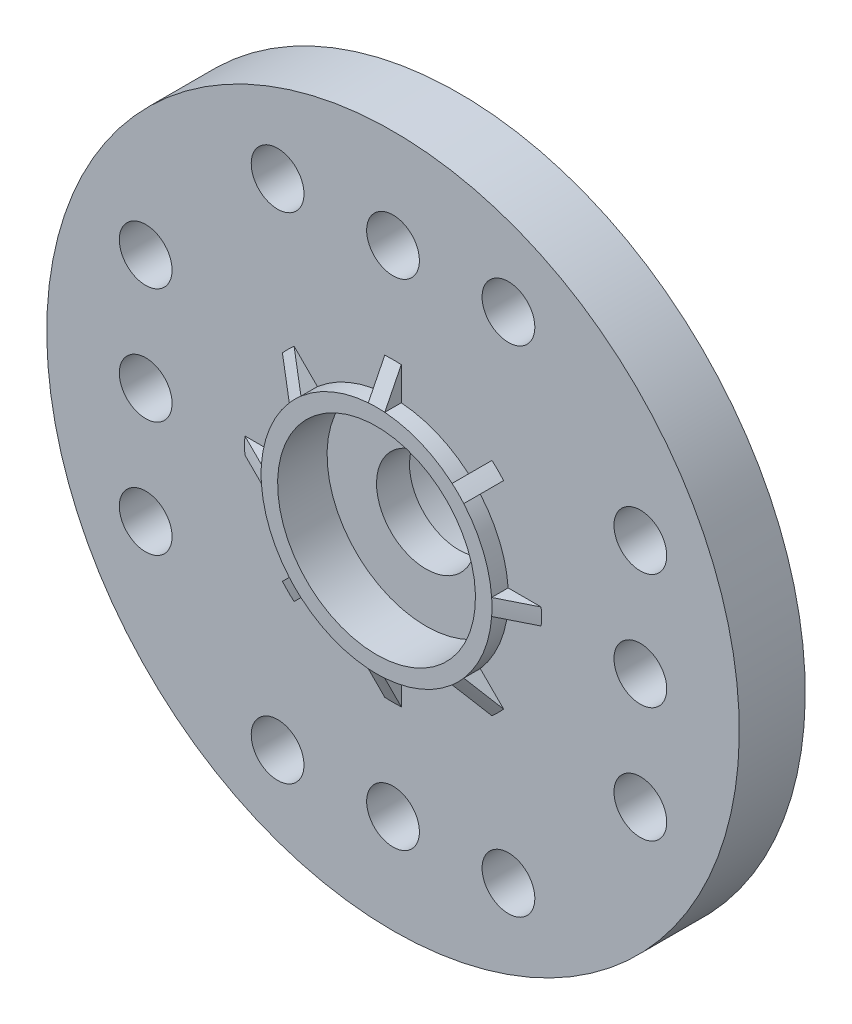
ISO-10303-21;
HEADER;
FILE_DESCRIPTION(('STEP AP214'),'2;1');
FILE_NAME('part.step','',(''),(''),'','','');
FILE_SCHEMA(('AUTOMOTIVE_DESIGN { 1 0 10303 214 1 1 1 1 }'));
ENDSEC;
DATA;
#1=APPLICATION_CONTEXT('core data for automotive mechanical design processes');
#2=APPLICATION_PROTOCOL_DEFINITION('international standard','automotive_design',2000,#1);
#3=PRODUCT_CONTEXT('',#1,'mechanical');
#4=PRODUCT('Part','Part','',(#3));
#5=PRODUCT_RELATED_PRODUCT_CATEGORY('part','',(#4));
#6=PRODUCT_DEFINITION_FORMATION('','',#4);
#7=PRODUCT_DEFINITION_CONTEXT('part definition',#1,'design');
#8=PRODUCT_DEFINITION('design','',#6,#7);
#9=PRODUCT_DEFINITION_SHAPE('','',#8);
#10=(LENGTH_UNIT() NAMED_UNIT(*) SI_UNIT(.MILLI.,.METRE.));
#11=(NAMED_UNIT(*) PLANE_ANGLE_UNIT() SI_UNIT($,.RADIAN.));
#12=(NAMED_UNIT(*) SI_UNIT($,.STERADIAN.) SOLID_ANGLE_UNIT());
#13=UNCERTAINTY_MEASURE_WITH_UNIT(LENGTH_MEASURE(1.E-05),#10,'distance_accuracy_value','');
#14=(GEOMETRIC_REPRESENTATION_CONTEXT(3) GLOBAL_UNCERTAINTY_ASSIGNED_CONTEXT((#13)) GLOBAL_UNIT_ASSIGNED_CONTEXT((#10,
#11,#12)) REPRESENTATION_CONTEXT('',''));
#15=CARTESIAN_POINT('',(0.,0.,0.));
#16=DIRECTION('',(0.,0.,1.));
#17=DIRECTION('',(1.,0.,0.));
#18=AXIS2_PLACEMENT_3D('',#15,#16,#17);
#19=CARTESIAN_POINT('',(0.622671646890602,-1.9559025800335,-2.));
#20=DIRECTION('',(0.,0.,1.));
#21=DIRECTION('',(0.,-1.,0.));
#22=AXIS2_PLACEMENT_3D('',#19,#20,#21);
#23=PLANE('',#22);
#24=CARTESIAN_POINT('',(0.,0.,-2.));
#25=DIRECTION('',(0.,0.,-1.));
#26=DIRECTION('',(0.,1.,0.));
#27=AXIS2_PLACEMENT_3D('',#24,#25,#26);
#28=CIRCLE('',#27,3.);
#29=CARTESIAN_POINT('',(0.,3.,-2.));
#30=VERTEX_POINT('',#29);
#31=EDGE_CURVE('E17',#30,#30,#28,.T.);
#32=ORIENTED_EDGE('',*,*,#31,.T.);
#33=EDGE_LOOP('',(#32));
#34=FACE_BOUND('',#33,.T.);
#35=CARTESIAN_POINT('',(0.,0.,-2.));
#36=DIRECTION('',(0.,0.,1.));
#37=DIRECTION('',(0.,-1.,0.));
#38=AXIS2_PLACEMENT_3D('',#35,#36,#37);
#39=CIRCLE('',#38,1.5);
#40=CARTESIAN_POINT('',(0.,-1.5,-2.));
#41=VERTEX_POINT('',#40);
#42=EDGE_CURVE('E582',#41,#41,#39,.T.);
#43=ORIENTED_EDGE('',*,*,#42,.T.);
#44=EDGE_LOOP('',(#43));
#45=FACE_BOUND('',#44,.T.);
#46=ADVANCED_FACE('F14',(#34,#45),#23,.F.);
#47=CARTESIAN_POINT('',(0.,0.,-5.7));
#48=DIRECTION('',(0.,0.,-1.));
#49=DIRECTION('',(0.,1.,0.));
#50=AXIS2_PLACEMENT_3D('',#47,#48,#49);
#51=CYLINDRICAL_SURFACE('',#50,3.);
#52=ORIENTED_EDGE('',*,*,#31,.F.);
#53=EDGE_LOOP('',(#52));
#54=FACE_BOUND('',#53,.T.);
#55=CARTESIAN_POINT('',(0.,0.,-5.7));
#56=DIRECTION('',(0.,0.,-1.));
#57=DIRECTION('',(0.,1.,0.));
#58=AXIS2_PLACEMENT_3D('',#55,#56,#57);
#59=CIRCLE('',#58,3.);
#60=CARTESIAN_POINT('',(0.,3.,-5.7));
#61=VERTEX_POINT('',#60);
#62=EDGE_CURVE('E580',#61,#61,#59,.F.);
#63=ORIENTED_EDGE('',*,*,#62,.F.);
#64=EDGE_LOOP('',(#63));
#65=FACE_BOUND('',#64,.T.);
#66=ADVANCED_FACE('F590',(#54,#65),#51,.F.);
#67=CARTESIAN_POINT('',(0.,0.,-6.3640024));
#68=DIRECTION('',(0.,0.,1.));
#69=DIRECTION('',(0.,-1.,0.));
#70=AXIS2_PLACEMENT_3D('',#67,#68,#69);
#71=CYLINDRICAL_SURFACE('',#70,1.5);
#72=ORIENTED_EDGE('',*,*,#42,.F.);
#73=EDGE_LOOP('',(#72));
#74=FACE_BOUND('',#73,.T.);
#75=CARTESIAN_POINT('',(0.,0.,-0.999999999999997));
#76=DIRECTION('',(0.,0.,1.));
#77=DIRECTION('',(0.,-1.,0.));
#78=AXIS2_PLACEMENT_3D('',#75,#76,#77);
#79=CIRCLE('',#78,1.5);
#80=CARTESIAN_POINT('',(0.,-1.5,-0.999999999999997));
#81=VERTEX_POINT('',#80);
#82=EDGE_CURVE('E577',#81,#81,#79,.F.);
#83=ORIENTED_EDGE('',*,*,#82,.F.);
#84=EDGE_LOOP('',(#83));
#85=FACE_BOUND('',#84,.T.);
#86=ADVANCED_FACE('F593',(#74,#85),#71,.F.);
#87=CARTESIAN_POINT('',(-0.7954774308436,2.1560413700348,-5.7));
#88=DIRECTION('',(0.,0.,-1.));
#89=DIRECTION('',(0.,1.,0.));
#90=AXIS2_PLACEMENT_3D('',#87,#88,#89);
#91=PLANE('',#90);
#92=CARTESIAN_POINT('',(0.,0.,-5.7));
#93=DIRECTION('',(0.,0.,-1.));
#94=DIRECTION('',(0.,1.,0.));
#95=AXIS2_PLACEMENT_3D('',#92,#93,#94);
#96=CIRCLE('',#95,4.);
#97=CARTESIAN_POINT('',(0.,4.,-5.7));
#98=VERTEX_POINT('',#97);
#99=EDGE_CURVE('E574',#98,#98,#96,.F.);
#100=ORIENTED_EDGE('',*,*,#99,.F.);
#101=EDGE_LOOP('',(#100));
#102=FACE_BOUND('',#101,.T.);
#103=ORIENTED_EDGE('',*,*,#62,.T.);
#104=EDGE_LOOP('',(#103));
#105=FACE_BOUND('',#104,.T.);
#106=ADVANCED_FACE('F596',(#102,#105),#91,.T.);
#107=CARTESIAN_POINT('',(7.45936212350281,2.7212549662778,-0.999999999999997));
#108=DIRECTION('',(0.,0.,1.));
#109=DIRECTION('',(0.,-1.,0.));
#110=AXIS2_PLACEMENT_3D('',#107,#108,#109);
#111=PLANE('',#110);
#112=CARTESIAN_POINT('',(0.,0.,-0.999999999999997));
#113=DIRECTION('',(0.,0.,1.));
#114=DIRECTION('',(0.,-1.,0.));
#115=AXIS2_PLACEMENT_3D('',#112,#113,#114);
#116=CIRCLE('',#115,3.);
#117=CARTESIAN_POINT('',(0.,-3.,-0.999999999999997));
#118=VERTEX_POINT('',#117);
#119=EDGE_CURVE('E571',#118,#118,#116,.T.);
#120=ORIENTED_EDGE('',*,*,#119,.T.);
#121=EDGE_LOOP('',(#120));
#122=FACE_BOUND('',#121,.T.);
#123=ORIENTED_EDGE('',*,*,#82,.T.);
#124=EDGE_LOOP('',(#123));
#125=FACE_BOUND('',#124,.T.);
#126=ADVANCED_FACE('F598',(#122,#125),#111,.T.);
#127=CARTESIAN_POINT('',(0.,0.,-2.));
#128=DIRECTION('',(0.,0.,-1.));
#129=DIRECTION('',(0.,1.,0.));
#130=AXIS2_PLACEMENT_3D('',#127,#128,#129);
#131=CYLINDRICAL_SURFACE('',#130,4.);
#132=ORIENTED_EDGE('',*,*,#99,.T.);
#133=EDGE_LOOP('',(#132));
#134=FACE_BOUND('',#133,.T.);
#135=CARTESIAN_POINT('',(0.,0.,-2.));
#136=DIRECTION('',(0.,0.,-1.));
#137=DIRECTION('',(0.,1.,0.));
#138=AXIS2_PLACEMENT_3D('',#135,#136,#137);
#139=CIRCLE('',#138,4.);
#140=CARTESIAN_POINT('',(0.,4.,-2.));
#141=VERTEX_POINT('',#140);
#142=EDGE_CURVE('E568',#141,#141,#139,.T.);
#143=ORIENTED_EDGE('',*,*,#142,.T.);
#144=EDGE_LOOP('',(#143));
#145=FACE_BOUND('',#144,.T.);
#146=ADVANCED_FACE('F606',(#134,#145),#131,.T.);
#147=CARTESIAN_POINT('',(0.,0.,0.));
#148=DIRECTION('',(0.,0.,1.));
#149=DIRECTION('',(0.,-1.,0.));
#150=AXIS2_PLACEMENT_3D('',#147,#148,#149);
#151=CYLINDRICAL_SURFACE('',#150,3.);
#152=ORIENTED_EDGE('',*,*,#119,.F.);
#153=EDGE_LOOP('',(#152));
#154=FACE_BOUND('',#153,.T.);
#155=CARTESIAN_POINT('',(0.,0.,0.5));
#156=DIRECTION('',(0.,0.,1.));
#157=DIRECTION('',(0.,-1.,0.));
#158=AXIS2_PLACEMENT_3D('',#155,#156,#157);
#159=CIRCLE('',#158,3.);
#160=CARTESIAN_POINT('',(0.,-3.,0.5));
#161=VERTEX_POINT('',#160);
#162=EDGE_CURVE('E565',#161,#161,#159,.F.);
#163=ORIENTED_EDGE('',*,*,#162,.F.);
#164=EDGE_LOOP('',(#163));
#165=FACE_BOUND('',#164,.T.);
#166=ADVANCED_FACE('F664',(#154,#165),#151,.F.);
#167=CARTESIAN_POINT('',(0.622671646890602,-1.9559025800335,-2.));
#168=DIRECTION('',(0.,0.,1.));
#169=DIRECTION('',(0.,-1.,0.));
#170=AXIS2_PLACEMENT_3D('',#167,#168,#169);
#171=PLANE('',#170);
#172=CARTESIAN_POINT('',(0.,0.,-2.));
#173=DIRECTION('',(0.,0.,1.));
#174=DIRECTION('',(0.,-1.,0.));
#175=AXIS2_PLACEMENT_3D('',#172,#173,#174);
#176=CIRCLE('',#175,10.5);
#177=CARTESIAN_POINT('',(0.,-10.5,-2.));
#178=VERTEX_POINT('',#177);
#179=EDGE_CURVE('E157',#178,#178,#176,.T.);
#180=ORIENTED_EDGE('',*,*,#179,.F.);
#181=EDGE_LOOP('',(#180));
#182=FACE_BOUND('',#181,.T.);
#183=ORIENTED_EDGE('',*,*,#142,.F.);
#184=EDGE_LOOP('',(#183));
#185=FACE_BOUND('',#184,.T.);
#186=CARTESIAN_POINT('',(3.5,-7.5,-2.));
#187=DIRECTION('',(0.,0.,1.));
#188=DIRECTION('',(0.,-1.,0.));
#189=AXIS2_PLACEMENT_3D('',#186,#187,#188);
#190=CIRCLE('',#189,0.799999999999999);
#191=CARTESIAN_POINT('',(3.5,-8.3,-2.));
#192=VERTEX_POINT('',#191);
#193=EDGE_CURVE('E538',#192,#192,#190,.T.);
#194=ORIENTED_EDGE('',*,*,#193,.T.);
#195=EDGE_LOOP('',(#194));
#196=FACE_BOUND('',#195,.T.);
#197=CARTESIAN_POINT('',(7.5,-3.5,-2.));
#198=DIRECTION('',(0.,0.,1.));
#199=DIRECTION('',(0.,-1.,0.));
#200=AXIS2_PLACEMENT_3D('',#197,#198,#199);
#201=CIRCLE('',#200,0.799999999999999);
#202=CARTESIAN_POINT('',(7.5,-4.3,-2.));
#203=VERTEX_POINT('',#202);
#204=EDGE_CURVE('E529',#203,#203,#201,.T.);
#205=ORIENTED_EDGE('',*,*,#204,.T.);
#206=EDGE_LOOP('',(#205));
#207=FACE_BOUND('',#206,.T.);
#208=CARTESIAN_POINT('',(7.5,3.5,-2.));
#209=DIRECTION('',(0.,0.,1.));
#210=DIRECTION('',(0.,-1.,0.));
#211=AXIS2_PLACEMENT_3D('',#208,#209,#210);
#212=CIRCLE('',#211,0.799999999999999);
#213=CARTESIAN_POINT('',(7.5,2.7,-2.));
#214=VERTEX_POINT('',#213);
#215=EDGE_CURVE('E556',#214,#214,#212,.T.);
#216=ORIENTED_EDGE('',*,*,#215,.T.);
#217=EDGE_LOOP('',(#216));
#218=FACE_BOUND('',#217,.T.);
#219=CARTESIAN_POINT('',(0.,7.5,-2.));
#220=DIRECTION('',(0.,0.,1.));
#221=DIRECTION('',(0.,-1.,0.));
#222=AXIS2_PLACEMENT_3D('',#219,#220,#221);
#223=CIRCLE('',#222,0.799999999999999);
#224=CARTESIAN_POINT('',(0.,6.7,-2.));
#225=VERTEX_POINT('',#224);
#226=EDGE_CURVE('E541',#225,#225,#223,.T.);
#227=ORIENTED_EDGE('',*,*,#226,.T.);
#228=EDGE_LOOP('',(#227));
#229=FACE_BOUND('',#228,.T.);
#230=CARTESIAN_POINT('',(-7.5,0.,-2.));
#231=DIRECTION('',(0.,0.,1.));
#232=DIRECTION('',(0.,-1.,0.));
#233=AXIS2_PLACEMENT_3D('',#230,#231,#232);
#234=CIRCLE('',#233,0.799999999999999);
#235=CARTESIAN_POINT('',(-7.5,-0.799999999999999,-2.));
#236=VERTEX_POINT('',#235);
#237=EDGE_CURVE('E544',#236,#236,#234,.T.);
#238=ORIENTED_EDGE('',*,*,#237,.T.);
#239=EDGE_LOOP('',(#238));
#240=FACE_BOUND('',#239,.T.);
#241=CARTESIAN_POINT('',(-7.5,3.5,-2.));
#242=DIRECTION('',(0.,0.,1.));
#243=DIRECTION('',(0.,-1.,0.));
#244=AXIS2_PLACEMENT_3D('',#241,#242,#243);
#245=CIRCLE('',#244,0.799999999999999);
#246=CARTESIAN_POINT('',(-7.5,2.7,-2.));
#247=VERTEX_POINT('',#246);
#248=EDGE_CURVE('E562',#247,#247,#245,.T.);
#249=ORIENTED_EDGE('',*,*,#248,.T.);
#250=EDGE_LOOP('',(#249));
#251=FACE_BOUND('',#250,.T.);
#252=CARTESIAN_POINT('',(-3.5,-7.5,-2.));
#253=DIRECTION('',(0.,0.,1.));
#254=DIRECTION('',(0.,-1.,0.));
#255=AXIS2_PLACEMENT_3D('',#252,#253,#254);
#256=CIRCLE('',#255,0.799999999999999);
#257=CARTESIAN_POINT('',(-3.5,-8.3,-2.));
#258=VERTEX_POINT('',#257);
#259=EDGE_CURVE('E553',#258,#258,#256,.T.);
#260=ORIENTED_EDGE('',*,*,#259,.T.);
#261=EDGE_LOOP('',(#260));
#262=FACE_BOUND('',#261,.T.);
#263=CARTESIAN_POINT('',(0.,-7.5,-2.));
#264=DIRECTION('',(0.,0.,1.));
#265=DIRECTION('',(0.,-1.,0.));
#266=AXIS2_PLACEMENT_3D('',#263,#264,#265);
#267=CIRCLE('',#266,0.799999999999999);
#268=CARTESIAN_POINT('',(0.,-8.3,-2.));
#269=VERTEX_POINT('',#268);
#270=EDGE_CURVE('E559',#269,#269,#267,.T.);
#271=ORIENTED_EDGE('',*,*,#270,.T.);
#272=EDGE_LOOP('',(#271));
#273=FACE_BOUND('',#272,.T.);
#274=CARTESIAN_POINT('',(-7.5,-3.5,-2.));
#275=DIRECTION('',(0.,0.,1.));
#276=DIRECTION('',(0.,-1.,0.));
#277=AXIS2_PLACEMENT_3D('',#274,#275,#276);
#278=CIRCLE('',#277,0.799999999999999);
#279=CARTESIAN_POINT('',(-7.5,-4.3,-2.));
#280=VERTEX_POINT('',#279);
#281=EDGE_CURVE('E532',#280,#280,#278,.T.);
#282=ORIENTED_EDGE('',*,*,#281,.T.);
#283=EDGE_LOOP('',(#282));
#284=FACE_BOUND('',#283,.T.);
#285=CARTESIAN_POINT('',(3.5,7.5,-2.));
#286=DIRECTION('',(0.,0.,1.));
#287=DIRECTION('',(0.,-1.,0.));
#288=AXIS2_PLACEMENT_3D('',#285,#286,#287);
#289=CIRCLE('',#288,0.799999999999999);
#290=CARTESIAN_POINT('',(3.5,6.7,-2.));
#291=VERTEX_POINT('',#290);
#292=EDGE_CURVE('E547',#291,#291,#289,.T.);
#293=ORIENTED_EDGE('',*,*,#292,.T.);
#294=EDGE_LOOP('',(#293));
#295=FACE_BOUND('',#294,.T.);
#296=CARTESIAN_POINT('',(-3.5,7.5,-2.));
#297=DIRECTION('',(0.,0.,1.));
#298=DIRECTION('',(0.,-1.,0.));
#299=AXIS2_PLACEMENT_3D('',#296,#297,#298);
#300=CIRCLE('',#299,0.799999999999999);
#301=CARTESIAN_POINT('',(-3.5,6.7,-2.));
#302=VERTEX_POINT('',#301);
#303=EDGE_CURVE('E550',#302,#302,#300,.T.);
#304=ORIENTED_EDGE('',*,*,#303,.T.);
#305=EDGE_LOOP('',(#304));
#306=FACE_BOUND('',#305,.T.);
#307=CARTESIAN_POINT('',(7.5,0.,-2.));
#308=DIRECTION('',(0.,0.,1.));
#309=DIRECTION('',(0.,-1.,0.));
#310=AXIS2_PLACEMENT_3D('',#307,#308,#309);
#311=CIRCLE('',#310,0.799999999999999);
#312=CARTESIAN_POINT('',(7.5,-0.799999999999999,-2.));
#313=VERTEX_POINT('',#312);
#314=EDGE_CURVE('E535',#313,#313,#311,.T.);
#315=ORIENTED_EDGE('',*,*,#314,.T.);
#316=EDGE_LOOP('',(#315));
#317=FACE_BOUND('',#316,.T.);
#318=ADVANCED_FACE('F657',(#182,#185,#196,#207,#218,#229,#240,#251,#262,#273,#284,#295,#306,
#317),#171,.F.);
#319=CARTESIAN_POINT('',(2.3403190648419,5.0055970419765,0.5));
#320=DIRECTION('',(0.,0.,1.));
#321=DIRECTION('',(0.,-1.,0.));
#322=AXIS2_PLACEMENT_3D('',#319,#320,#321);
#323=PLANE('',#322);
#324=CARTESIAN_POINT('',(0.,0.,0.499999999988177));
#325=DIRECTION('',(0.,0.,-1.));
#326=DIRECTION('',(-1.,0.,0.));
#327=AXIS2_PLACEMENT_3D('',#324,#325,#326);
#328=CIRCLE('',#327,3.50000000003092);
#329=CARTESIAN_POINT('',(2.2917755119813,2.64532890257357,0.499999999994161));
#330=VERTEX_POINT('',#329);
#331=CARTESIAN_POINT('',(2.64532890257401,2.29177551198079,0.499999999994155));
#332=VERTEX_POINT('',#331);
#333=EDGE_CURVE('E316',#330,#332,#328,.T.);
#334=ORIENTED_EDGE('',*,*,#333,.F.);
#335=CARTESIAN_POINT('',(0.,0.,0.500000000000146));
#336=DIRECTION('',(0.,0.,1.));
#337=DIRECTION('',(0.,-1.,0.));
#338=AXIS2_PLACEMENT_3D('',#335,#336,#337);
#339=CIRCLE('',#338,3.5);
#340=CARTESIAN_POINT('',(0.25,3.49106001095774,0.499999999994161));
#341=VERTEX_POINT('',#340);
#342=EDGE_CURVE('E153',#341,#330,#339,.F.);
#343=ORIENTED_EDGE('',*,*,#342,.F.);
#344=CARTESIAN_POINT('',(0.,0.,0.499999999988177));
#345=DIRECTION('',(0.,0.,-1.));
#346=DIRECTION('',(-1.,0.,0.));
#347=AXIS2_PLACEMENT_3D('',#344,#345,#346);
#348=CIRCLE('',#347,3.50000000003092);
#349=CARTESIAN_POINT('',(-0.24999999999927,3.49106001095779,0.499999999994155));
#350=VERTEX_POINT('',#349);
#351=EDGE_CURVE('E145',#350,#341,#348,.T.);
#352=ORIENTED_EDGE('',*,*,#351,.F.);
#353=CARTESIAN_POINT('',(0.,0.,0.500000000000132));
#354=DIRECTION('',(0.,0.,1.));
#355=DIRECTION('',(0.,-1.,0.));
#356=AXIS2_PLACEMENT_3D('',#353,#354,#355);
#357=CIRCLE('',#356,3.5);
#358=CARTESIAN_POINT('',(-2.29177551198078,2.64532890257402,0.499999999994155));
#359=VERTEX_POINT('',#358);
#360=EDGE_CURVE('E150',#359,#350,#357,.F.);
#361=ORIENTED_EDGE('',*,*,#360,.F.);
#362=CARTESIAN_POINT('',(0.,0.,0.499999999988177));
#363=DIRECTION('',(0.,0.,-1.));
#364=DIRECTION('',(-1.,0.,0.));
#365=AXIS2_PLACEMENT_3D('',#362,#363,#364);
#366=CIRCLE('',#365,3.50000000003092);
#367=CARTESIAN_POINT('',(-2.64532890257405,2.29177551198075,0.499999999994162));
#368=VERTEX_POINT('',#367);
#369=EDGE_CURVE('E505',#368,#359,#366,.T.);
#370=ORIENTED_EDGE('',*,*,#369,.F.);
#371=CARTESIAN_POINT('',(0.,0.,0.500000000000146));
#372=DIRECTION('',(0.,0.,1.));
#373=DIRECTION('',(0.,-1.,0.));
#374=AXIS2_PLACEMENT_3D('',#371,#372,#373);
#375=CIRCLE('',#374,3.5);
#376=CARTESIAN_POINT('',(-3.49106001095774,0.250000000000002,0.499999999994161));
#377=VERTEX_POINT('',#376);
#378=EDGE_CURVE('E504',#377,#368,#375,.F.);
#379=ORIENTED_EDGE('',*,*,#378,.F.);
#380=CARTESIAN_POINT('',(0.,0.,0.499999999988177));
#381=DIRECTION('',(0.,0.,-1.));
#382=DIRECTION('',(-1.,0.,0.));
#383=AXIS2_PLACEMENT_3D('',#380,#381,#382);
#384=CIRCLE('',#383,3.50000000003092);
#385=CARTESIAN_POINT('',(-3.49106001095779,-0.249999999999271,0.499999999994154));
#386=VERTEX_POINT('',#385);
#387=EDGE_CURVE('E479',#386,#377,#384,.T.);
#388=ORIENTED_EDGE('',*,*,#387,.F.);
#389=CARTESIAN_POINT('',(0.,0.,0.500000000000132));
#390=DIRECTION('',(0.,0.,1.));
#391=DIRECTION('',(0.,-1.,0.));
#392=AXIS2_PLACEMENT_3D('',#389,#390,#391);
#393=CIRCLE('',#392,3.5);
#394=CARTESIAN_POINT('',(-2.64532890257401,-2.29177551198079,0.499999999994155));
#395=VERTEX_POINT('',#394);
#396=EDGE_CURVE('E449',#395,#386,#393,.F.);
#397=ORIENTED_EDGE('',*,*,#396,.F.);
#398=CARTESIAN_POINT('',(0.,0.,0.499999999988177));
#399=DIRECTION('',(0.,0.,-1.));
#400=DIRECTION('',(-1.,0.,0.));
#401=AXIS2_PLACEMENT_3D('',#398,#399,#400);
#402=CIRCLE('',#401,3.50000000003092);
#403=CARTESIAN_POINT('',(-2.2917755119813,-2.64532890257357,0.499999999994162));
#404=VERTEX_POINT('',#403);
#405=EDGE_CURVE('E440',#404,#395,#402,.T.);
#406=ORIENTED_EDGE('',*,*,#405,.F.);
#407=CARTESIAN_POINT('',(0.,0.,0.500000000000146));
#408=DIRECTION('',(0.,0.,1.));
#409=DIRECTION('',(0.,-1.,0.));
#410=AXIS2_PLACEMENT_3D('',#407,#408,#409);
#411=CIRCLE('',#410,3.5);
#412=CARTESIAN_POINT('',(-0.250000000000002,-3.49106001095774,0.499999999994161));
#413=VERTEX_POINT('',#412);
#414=EDGE_CURVE('E415',#413,#404,#411,.F.);
#415=ORIENTED_EDGE('',*,*,#414,.F.);
#416=CARTESIAN_POINT('',(0.,0.,0.499999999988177));
#417=DIRECTION('',(0.,0.,-1.));
#418=DIRECTION('',(-1.,0.,0.));
#419=AXIS2_PLACEMENT_3D('',#416,#417,#418);
#420=CIRCLE('',#419,3.50000000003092);
#421=CARTESIAN_POINT('',(0.249999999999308,-3.49106001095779,0.499999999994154));
#422=VERTEX_POINT('',#421);
#423=EDGE_CURVE('E405',#422,#413,#420,.T.);
#424=ORIENTED_EDGE('',*,*,#423,.F.);
#425=CARTESIAN_POINT('',(0.,0.,0.500000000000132));
#426=DIRECTION('',(0.,0.,1.));
#427=DIRECTION('',(0.,-1.,0.));
#428=AXIS2_PLACEMENT_3D('',#425,#426,#427);
#429=CIRCLE('',#428,3.5);
#430=CARTESIAN_POINT('',(2.29177551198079,-2.64532890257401,0.499999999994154));
#431=VERTEX_POINT('',#430);
#432=EDGE_CURVE('E406',#431,#422,#429,.F.);
#433=ORIENTED_EDGE('',*,*,#432,.F.);
#434=CARTESIAN_POINT('',(0.,0.,0.499999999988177));
#435=DIRECTION('',(0.,0.,-1.));
#436=DIRECTION('',(-1.,0.,0.));
#437=AXIS2_PLACEMENT_3D('',#434,#435,#436);
#438=CIRCLE('',#437,3.50000000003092);
#439=CARTESIAN_POINT('',(2.64532890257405,-2.29177551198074,0.499999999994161));
#440=VERTEX_POINT('',#439);
#441=EDGE_CURVE('E379',#440,#431,#438,.T.);
#442=ORIENTED_EDGE('',*,*,#441,.F.);
#443=CARTESIAN_POINT('',(0.,0.,0.500000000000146));
#444=DIRECTION('',(0.,0.,1.));
#445=DIRECTION('',(0.,-1.,0.));
#446=AXIS2_PLACEMENT_3D('',#443,#444,#445);
#447=CIRCLE('',#446,3.5);
#448=CARTESIAN_POINT('',(3.49106001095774,-0.250000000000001,0.499999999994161));
#449=VERTEX_POINT('',#448);
#450=EDGE_CURVE('E373',#449,#440,#447,.F.);
#451=ORIENTED_EDGE('',*,*,#450,.F.);
#452=CARTESIAN_POINT('',(0.,0.,0.499999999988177));
#453=DIRECTION('',(0.,0.,-1.));
#454=DIRECTION('',(-1.,0.,0.));
#455=AXIS2_PLACEMENT_3D('',#452,#453,#454);
#456=CIRCLE('',#455,3.50000000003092);
#457=CARTESIAN_POINT('',(3.49106001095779,0.249999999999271,0.499999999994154));
#458=VERTEX_POINT('',#457);
#459=EDGE_CURVE('E348',#458,#449,#456,.T.);
#460=ORIENTED_EDGE('',*,*,#459,.F.);
#461=CARTESIAN_POINT('',(0.,0.,0.500000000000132));
#462=DIRECTION('',(0.,0.,1.));
#463=DIRECTION('',(0.,-1.,0.));
#464=AXIS2_PLACEMENT_3D('',#461,#462,#463);
#465=CIRCLE('',#464,3.5);
#466=EDGE_CURVE('E343',#332,#458,#465,.F.);
#467=ORIENTED_EDGE('',*,*,#466,.F.);
#468=EDGE_LOOP('',(#334,#343,#352,#361,#370,#379,#388,#397,#406,#415,#424,#433,#442,#451,#460,#467));
#469=FACE_BOUND('',#468,.T.);
#470=ORIENTED_EDGE('',*,*,#162,.T.);
#471=EDGE_LOOP('',(#470));
#472=FACE_BOUND('',#471,.T.);
#473=ADVANCED_FACE('F147',(#469,#472),#323,.T.);
#474=CARTESIAN_POINT('',(-7.5,3.5,-6.3640024));
#475=DIRECTION('',(0.,0.,1.));
#476=DIRECTION('',(0.,-1.,0.));
#477=AXIS2_PLACEMENT_3D('',#474,#475,#476);
#478=CYLINDRICAL_SURFACE('',#477,0.799999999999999);
#479=ORIENTED_EDGE('',*,*,#248,.F.);
#480=EDGE_LOOP('',(#479));
#481=FACE_BOUND('',#480,.T.);
#482=CARTESIAN_POINT('',(-7.5,3.5,0.));
#483=DIRECTION('',(0.,0.,1.));
#484=DIRECTION('',(0.,-1.,0.));
#485=AXIS2_PLACEMENT_3D('',#482,#483,#484);
#486=CIRCLE('',#485,0.799999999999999);
#487=CARTESIAN_POINT('',(-7.5,2.7,0.));
#488=VERTEX_POINT('',#487);
#489=EDGE_CURVE('E274',#488,#488,#486,.T.);
#490=ORIENTED_EDGE('',*,*,#489,.T.);
#491=EDGE_LOOP('',(#490));
#492=FACE_BOUND('',#491,.T.);
#493=ADVANCED_FACE('F645',(#481,#492),#478,.F.);
#494=CARTESIAN_POINT('',(0.,-7.5,-6.3640024));
#495=DIRECTION('',(0.,0.,1.));
#496=DIRECTION('',(0.,-1.,0.));
#497=AXIS2_PLACEMENT_3D('',#494,#495,#496);
#498=CYLINDRICAL_SURFACE('',#497,0.799999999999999);
#499=ORIENTED_EDGE('',*,*,#270,.F.);
#500=EDGE_LOOP('',(#499));
#501=FACE_BOUND('',#500,.T.);
#502=CARTESIAN_POINT('',(0.,-7.5,0.));
#503=DIRECTION('',(0.,0.,1.));
#504=DIRECTION('',(0.,-1.,0.));
#505=AXIS2_PLACEMENT_3D('',#502,#503,#504);
#506=CIRCLE('',#505,0.799999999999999);
#507=CARTESIAN_POINT('',(0.,-8.3,0.));
#508=VERTEX_POINT('',#507);
#509=EDGE_CURVE('E271',#508,#508,#506,.T.);
#510=ORIENTED_EDGE('',*,*,#509,.T.);
#511=EDGE_LOOP('',(#510));
#512=FACE_BOUND('',#511,.T.);
#513=ADVANCED_FACE('F647',(#501,#512),#498,.F.);
#514=CARTESIAN_POINT('',(7.5,3.5,-6.3640024));
#515=DIRECTION('',(0.,0.,1.));
#516=DIRECTION('',(0.,-1.,0.));
#517=AXIS2_PLACEMENT_3D('',#514,#515,#516);
#518=CYLINDRICAL_SURFACE('',#517,0.799999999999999);
#519=ORIENTED_EDGE('',*,*,#215,.F.);
#520=EDGE_LOOP('',(#519));
#521=FACE_BOUND('',#520,.T.);
#522=CARTESIAN_POINT('',(7.5,3.5,0.));
#523=DIRECTION('',(0.,0.,1.));
#524=DIRECTION('',(0.,-1.,0.));
#525=AXIS2_PLACEMENT_3D('',#522,#523,#524);
#526=CIRCLE('',#525,0.799999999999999);
#527=CARTESIAN_POINT('',(7.5,2.7,0.));
#528=VERTEX_POINT('',#527);
#529=EDGE_CURVE('E268',#528,#528,#526,.T.);
#530=ORIENTED_EDGE('',*,*,#529,.T.);
#531=EDGE_LOOP('',(#530));
#532=FACE_BOUND('',#531,.T.);
#533=ADVANCED_FACE('F654',(#521,#532),#518,.F.);
#534=CARTESIAN_POINT('',(-3.5,-7.5,-6.3640024));
#535=DIRECTION('',(0.,0.,1.));
#536=DIRECTION('',(0.,-1.,0.));
#537=AXIS2_PLACEMENT_3D('',#534,#535,#536);
#538=CYLINDRICAL_SURFACE('',#537,0.799999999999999);
#539=ORIENTED_EDGE('',*,*,#259,.F.);
#540=EDGE_LOOP('',(#539));
#541=FACE_BOUND('',#540,.T.);
#542=CARTESIAN_POINT('',(-3.5,-7.5,0.));
#543=DIRECTION('',(0.,0.,1.));
#544=DIRECTION('',(0.,-1.,0.));
#545=AXIS2_PLACEMENT_3D('',#542,#543,#544);
#546=CIRCLE('',#545,0.799999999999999);
#547=CARTESIAN_POINT('',(-3.5,-8.3,0.));
#548=VERTEX_POINT('',#547);
#549=EDGE_CURVE('E265',#548,#548,#546,.T.);
#550=ORIENTED_EDGE('',*,*,#549,.T.);
#551=EDGE_LOOP('',(#550));
#552=FACE_BOUND('',#551,.T.);
#553=ADVANCED_FACE('F731',(#541,#552),#538,.F.);
#554=CARTESIAN_POINT('',(-3.5,7.5,-6.3640024));
#555=DIRECTION('',(0.,0.,1.));
#556=DIRECTION('',(0.,-1.,0.));
#557=AXIS2_PLACEMENT_3D('',#554,#555,#556);
#558=CYLINDRICAL_SURFACE('',#557,0.799999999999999);
#559=ORIENTED_EDGE('',*,*,#303,.F.);
#560=EDGE_LOOP('',(#559));
#561=FACE_BOUND('',#560,.T.);
#562=CARTESIAN_POINT('',(-3.5,7.5,0.));
#563=DIRECTION('',(0.,0.,1.));
#564=DIRECTION('',(0.,-1.,0.));
#565=AXIS2_PLACEMENT_3D('',#562,#563,#564);
#566=CIRCLE('',#565,0.799999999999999);
#567=CARTESIAN_POINT('',(-3.5,6.7,0.));
#568=VERTEX_POINT('',#567);
#569=EDGE_CURVE('E262',#568,#568,#566,.T.);
#570=ORIENTED_EDGE('',*,*,#569,.T.);
#571=EDGE_LOOP('',(#570));
#572=FACE_BOUND('',#571,.T.);
#573=ADVANCED_FACE('F727',(#561,#572),#558,.F.);
#574=CARTESIAN_POINT('',(3.5,7.5,-6.3640024));
#575=DIRECTION('',(0.,0.,1.));
#576=DIRECTION('',(0.,-1.,0.));
#577=AXIS2_PLACEMENT_3D('',#574,#575,#576);
#578=CYLINDRICAL_SURFACE('',#577,0.799999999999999);
#579=ORIENTED_EDGE('',*,*,#292,.F.);
#580=EDGE_LOOP('',(#579));
#581=FACE_BOUND('',#580,.T.);
#582=CARTESIAN_POINT('',(3.5,7.5,0.));
#583=DIRECTION('',(0.,0.,1.));
#584=DIRECTION('',(0.,-1.,0.));
#585=AXIS2_PLACEMENT_3D('',#582,#583,#584);
#586=CIRCLE('',#585,0.799999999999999);
#587=CARTESIAN_POINT('',(3.5,6.7,0.));
#588=VERTEX_POINT('',#587);
#589=EDGE_CURVE('E259',#588,#588,#586,.T.);
#590=ORIENTED_EDGE('',*,*,#589,.T.);
#591=EDGE_LOOP('',(#590));
#592=FACE_BOUND('',#591,.T.);
#593=ADVANCED_FACE('F723',(#581,#592),#578,.F.);
#594=CARTESIAN_POINT('',(-7.5,0.,-6.3640024));
#595=DIRECTION('',(0.,0.,1.));
#596=DIRECTION('',(0.,-1.,0.));
#597=AXIS2_PLACEMENT_3D('',#594,#595,#596);
#598=CYLINDRICAL_SURFACE('',#597,0.799999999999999);
#599=ORIENTED_EDGE('',*,*,#237,.F.);
#600=EDGE_LOOP('',(#599));
#601=FACE_BOUND('',#600,.T.);
#602=CARTESIAN_POINT('',(-7.5,0.,0.));
#603=DIRECTION('',(0.,0.,1.));
#604=DIRECTION('',(0.,-1.,0.));
#605=AXIS2_PLACEMENT_3D('',#602,#603,#604);
#606=CIRCLE('',#605,0.799999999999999);
#607=CARTESIAN_POINT('',(-7.5,-0.799999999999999,0.));
#608=VERTEX_POINT('',#607);
#609=EDGE_CURVE('E256',#608,#608,#606,.T.);
#610=ORIENTED_EDGE('',*,*,#609,.T.);
#611=EDGE_LOOP('',(#610));
#612=FACE_BOUND('',#611,.T.);
#613=ADVANCED_FACE('F719',(#601,#612),#598,.F.);
#614=CARTESIAN_POINT('',(0.,7.5,-6.3640024));
#615=DIRECTION('',(0.,0.,1.));
#616=DIRECTION('',(0.,-1.,0.));
#617=AXIS2_PLACEMENT_3D('',#614,#615,#616);
#618=CYLINDRICAL_SURFACE('',#617,0.799999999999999);
#619=ORIENTED_EDGE('',*,*,#226,.F.);
#620=EDGE_LOOP('',(#619));
#621=FACE_BOUND('',#620,.T.);
#622=CARTESIAN_POINT('',(0.,7.5,0.));
#623=DIRECTION('',(0.,0.,1.));
#624=DIRECTION('',(0.,-1.,0.));
#625=AXIS2_PLACEMENT_3D('',#622,#623,#624);
#626=CIRCLE('',#625,0.799999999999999);
#627=CARTESIAN_POINT('',(0.,6.7,0.));
#628=VERTEX_POINT('',#627);
#629=EDGE_CURVE('E253',#628,#628,#626,.T.);
#630=ORIENTED_EDGE('',*,*,#629,.T.);
#631=EDGE_LOOP('',(#630));
#632=FACE_BOUND('',#631,.T.);
#633=ADVANCED_FACE('F713',(#621,#632),#618,.F.);
#634=CARTESIAN_POINT('',(3.5,-7.5,-6.3640024));
#635=DIRECTION('',(0.,0.,1.));
#636=DIRECTION('',(0.,-1.,0.));
#637=AXIS2_PLACEMENT_3D('',#634,#635,#636);
#638=CYLINDRICAL_SURFACE('',#637,0.799999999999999);
#639=ORIENTED_EDGE('',*,*,#193,.F.);
#640=EDGE_LOOP('',(#639));
#641=FACE_BOUND('',#640,.T.);
#642=CARTESIAN_POINT('',(3.5,-7.5,0.));
#643=DIRECTION('',(0.,0.,1.));
#644=DIRECTION('',(0.,-1.,0.));
#645=AXIS2_PLACEMENT_3D('',#642,#643,#644);
#646=CIRCLE('',#645,0.799999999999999);
#647=CARTESIAN_POINT('',(3.5,-8.3,0.));
#648=VERTEX_POINT('',#647);
#649=EDGE_CURVE('E250',#648,#648,#646,.T.);
#650=ORIENTED_EDGE('',*,*,#649,.T.);
#651=EDGE_LOOP('',(#650));
#652=FACE_BOUND('',#651,.T.);
#653=ADVANCED_FACE('F704',(#641,#652),#638,.F.);
#654=CARTESIAN_POINT('',(7.5,0.,-6.3640024));
#655=DIRECTION('',(0.,0.,1.));
#656=DIRECTION('',(0.,-1.,0.));
#657=AXIS2_PLACEMENT_3D('',#654,#655,#656);
#658=CYLINDRICAL_SURFACE('',#657,0.799999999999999);
#659=ORIENTED_EDGE('',*,*,#314,.F.);
#660=EDGE_LOOP('',(#659));
#661=FACE_BOUND('',#660,.T.);
#662=CARTESIAN_POINT('',(7.5,0.,0.));
#663=DIRECTION('',(0.,0.,1.));
#664=DIRECTION('',(0.,-1.,0.));
#665=AXIS2_PLACEMENT_3D('',#662,#663,#664);
#666=CIRCLE('',#665,0.799999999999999);
#667=CARTESIAN_POINT('',(7.5,-0.799999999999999,0.));
#668=VERTEX_POINT('',#667);
#669=EDGE_CURVE('E247',#668,#668,#666,.T.);
#670=ORIENTED_EDGE('',*,*,#669,.T.);
#671=EDGE_LOOP('',(#670));
#672=FACE_BOUND('',#671,.T.);
#673=ADVANCED_FACE('F700',(#661,#672),#658,.F.);
#674=CARTESIAN_POINT('',(-7.5,-3.5,-6.3640024));
#675=DIRECTION('',(0.,0.,1.));
#676=DIRECTION('',(0.,-1.,0.));
#677=AXIS2_PLACEMENT_3D('',#674,#675,#676);
#678=CYLINDRICAL_SURFACE('',#677,0.799999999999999);
#679=ORIENTED_EDGE('',*,*,#281,.F.);
#680=EDGE_LOOP('',(#679));
#681=FACE_BOUND('',#680,.T.);
#682=CARTESIAN_POINT('',(-7.5,-3.5,0.));
#683=DIRECTION('',(0.,0.,1.));
#684=DIRECTION('',(0.,-1.,0.));
#685=AXIS2_PLACEMENT_3D('',#682,#683,#684);
#686=CIRCLE('',#685,0.799999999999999);
#687=CARTESIAN_POINT('',(-7.5,-4.3,0.));
#688=VERTEX_POINT('',#687);
#689=EDGE_CURVE('E244',#688,#688,#686,.T.);
#690=ORIENTED_EDGE('',*,*,#689,.T.);
#691=EDGE_LOOP('',(#690));
#692=FACE_BOUND('',#691,.T.);
#693=ADVANCED_FACE('F703',(#681,#692),#678,.F.);
#694=CARTESIAN_POINT('',(7.5,-3.5,-6.3640024));
#695=DIRECTION('',(0.,0.,1.));
#696=DIRECTION('',(0.,-1.,0.));
#697=AXIS2_PLACEMENT_3D('',#694,#695,#696);
#698=CYLINDRICAL_SURFACE('',#697,0.799999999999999);
#699=ORIENTED_EDGE('',*,*,#204,.F.);
#700=EDGE_LOOP('',(#699));
#701=FACE_BOUND('',#700,.T.);
#702=CARTESIAN_POINT('',(7.5,-3.5,0.));
#703=DIRECTION('',(0.,0.,1.));
#704=DIRECTION('',(0.,-1.,0.));
#705=AXIS2_PLACEMENT_3D('',#702,#703,#704);
#706=CIRCLE('',#705,0.799999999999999);
#707=CARTESIAN_POINT('',(7.5,-4.3,0.));
#708=VERTEX_POINT('',#707);
#709=EDGE_CURVE('E241',#708,#708,#706,.T.);
#710=ORIENTED_EDGE('',*,*,#709,.T.);
#711=EDGE_LOOP('',(#710));
#712=FACE_BOUND('',#711,.T.);
#713=ADVANCED_FACE('F710',(#701,#712),#698,.F.);
#714=CARTESIAN_POINT('',(0.,0.,-2.));
#715=DIRECTION('',(0.,0.,1.));
#716=DIRECTION('',(0.,-1.,0.));
#717=AXIS2_PLACEMENT_3D('',#714,#715,#716);
#718=CYLINDRICAL_SURFACE('',#717,10.5);
#719=ORIENTED_EDGE('',*,*,#179,.T.);
#720=EDGE_LOOP('',(#719));
#721=FACE_BOUND('',#720,.T.);
#722=CARTESIAN_POINT('',(0.,0.,0.));
#723=DIRECTION('',(0.,0.,1.));
#724=DIRECTION('',(0.,-1.,0.));
#725=AXIS2_PLACEMENT_3D('',#722,#723,#724);
#726=CIRCLE('',#725,10.5);
#727=CARTESIAN_POINT('',(0.,-10.5,0.));
#728=VERTEX_POINT('',#727);
#729=EDGE_CURVE('E238',#728,#728,#726,.F.);
#730=ORIENTED_EDGE('',*,*,#729,.T.);
#731=EDGE_LOOP('',(#730));
#732=FACE_BOUND('',#731,.T.);
#733=ADVANCED_FACE('F521',(#721,#732),#718,.T.);
#734=CARTESIAN_POINT('',(-0.25,3.4910600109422,-0.299999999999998));
#735=DIRECTION('',(-1.,0.,0.));
#736=DIRECTION('',(0.,-1.,0.));
#737=AXIS2_PLACEMENT_3D('',#734,#735,#736);
#738=PLANE('',#737);
#739=CARTESIAN_POINT('',(-0.25,3.49106001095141,0.499999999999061));
#740=CARTESIAN_POINT('',(-0.25,3.65807495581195,0.416699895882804));
#741=CARTESIAN_POINT('',(-0.25,3.82508160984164,0.33338317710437));
#742=CARTESIAN_POINT('',(-0.25,4.15907833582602,0.166716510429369));
#743=CARTESIAN_POINT('',(-0.25,4.32606840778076,0.0833665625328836));
#744=CARTESIAN_POINT('',(-0.25,4.49305018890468,-2.56963873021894E-11));
#745=B_SPLINE_CURVE_WITH_KNOTS('',3,(#739,#740,#741,#742,#743,#744),.UNSPECIFIED.,.F.,.F.,(4,2,
4),(0.,0.55990720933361,1.11981441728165),.UNSPECIFIED.);
#746=CARTESIAN_POINT('',(-0.25,4.49305018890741,-2.70583257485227E-11));
#747=VERTEX_POINT('',#746);
#748=EDGE_CURVE('E156',#350,#747,#745,.T.);
#749=ORIENTED_EDGE('',*,*,#748,.T.);
#750=DIRECTION('',(0.,1.,0.));
#751=VECTOR('',#750,1.);
#752=CARTESIAN_POINT('',(-0.25,0.,0.));
#753=LINE('',#752,#751);
#754=CARTESIAN_POINT('',(-0.24999999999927,3.49106001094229,0.));
#755=VERTEX_POINT('',#754);
#756=EDGE_CURVE('E175',#747,#755,#753,.F.);
#757=ORIENTED_EDGE('',*,*,#756,.T.);
#758=DIRECTION('',(0.,0.,1.));
#759=VECTOR('',#758,1.);
#760=CARTESIAN_POINT('',(-0.249999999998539,3.49106001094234,0.));
#761=LINE('',#760,#759);
#762=EDGE_CURVE('E163',#350,#755,#761,.F.);
#763=ORIENTED_EDGE('',*,*,#762,.F.);
#764=EDGE_LOOP('',(#749,#757,#763));
#765=FACE_BOUND('',#764,.T.);
#766=ADVANCED_FACE('F174',(#765),#738,.T.);
#767=CARTESIAN_POINT('',(0.,0.,0.));
#768=DIRECTION('',(0.,0.,1.));
#769=DIRECTION('',(0.,-1.,0.));
#770=AXIS2_PLACEMENT_3D('',#767,#768,#769);
#771=CYLINDRICAL_SURFACE('',#770,3.5);
#772=DIRECTION('',(0.,0.,1.));
#773=VECTOR('',#772,1.);
#774=CARTESIAN_POINT('',(-2.29177551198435,2.64532890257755,-0.299999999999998));
#775=LINE('',#774,#773);
#776=CARTESIAN_POINT('',(-2.29177551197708,2.64532890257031,0.));
#777=VERTEX_POINT('',#776);
#778=EDGE_CURVE('E171',#359,#777,#775,.F.);
#779=ORIENTED_EDGE('',*,*,#778,.F.);
#780=ORIENTED_EDGE('',*,*,#360,.T.);
#781=ORIENTED_EDGE('',*,*,#762,.T.);
#782=CARTESIAN_POINT('',(0.,0.,0.));
#783=DIRECTION('',(0.,0.,1.));
#784=DIRECTION('',(0.,-1.,0.));
#785=AXIS2_PLACEMENT_3D('',#782,#783,#784);
#786=CIRCLE('',#785,3.5);
#787=EDGE_CURVE('E235',#755,#777,#786,.T.);
#788=ORIENTED_EDGE('',*,*,#787,.T.);
#789=EDGE_LOOP('',(#779,#780,#781,#788));
#790=FACE_BOUND('',#789,.T.);
#791=ADVANCED_FACE('F167',(#790),#771,.T.);
#792=CARTESIAN_POINT('',(-3.0002895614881,3.3538429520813,-0.299999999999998));
#793=DIRECTION('',(0.707106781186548,0.707106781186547,0.));
#794=DIRECTION('',(-0.707106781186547,0.707106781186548,0.));
#795=AXIS2_PLACEMENT_3D('',#792,#793,#794);
#796=PLANE('',#795);
#797=ORIENTED_EDGE('',*,*,#778,.T.);
#798=DIRECTION('',(-0.707106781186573,0.707106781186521,0.));
#799=VECTOR('',#798,1.);
#800=CARTESIAN_POINT('',(-2.29177551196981,2.64532890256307,0.));
#801=LINE('',#800,#799);
#802=CARTESIAN_POINT('',(-3.00028956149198,3.35384295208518,-2.75148704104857E-11));
#803=VERTEX_POINT('',#802);
#804=EDGE_CURVE('E234',#777,#803,#801,.T.);
#805=ORIENTED_EDGE('',*,*,#804,.T.);
#806=CARTESIAN_POINT('',(-2.29177551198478,2.64532890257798,0.499999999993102));
#807=CARTESIAN_POINT('',(-2.40987291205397,2.76342630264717,0.416699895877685));
#808=CARTESIAN_POINT('',(-2.52796444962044,2.88151784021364,0.333383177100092));
#809=CARTESIAN_POINT('',(-2.76413579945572,3.11768919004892,0.166716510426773));
#810=CARTESIAN_POINT('',(-2.88221561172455,3.23576900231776,0.0833665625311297));
#811=CARTESIAN_POINT('',(-3.00028956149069,3.3538429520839,-2.66079747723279E-11));
#812=B_SPLINE_CURVE_WITH_KNOTS('',3,(#806,#807,#808,#809,#810,#811),.UNSPECIFIED.,.F.,.F.,(4,2,
4),(0.,0.559907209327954,1.11981441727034),.UNSPECIFIED.);
#813=EDGE_CURVE('E507',#359,#803,#812,.T.);
#814=ORIENTED_EDGE('',*,*,#813,.F.);
#815=EDGE_LOOP('',(#797,#805,#814));
#816=FACE_BOUND('',#815,.T.);
#817=ADVANCED_FACE('F511',(#816),#796,.T.);
#818=CARTESIAN_POINT('',(0.,0.,2.8421709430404E-11));
#819=DIRECTION('',(0.,0.,-1.));
#820=DIRECTION('',(-1.,0.,0.));
#821=AXIS2_PLACEMENT_3D('',#818,#819,#820);
#822=CONICAL_SURFACE('',#821,4.49999999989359,1.10714871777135);
#823=CARTESIAN_POINT('',(-2.64532890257,2.2917755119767,0.499999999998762));
#824=CARTESIAN_POINT('',(-2.76342630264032,2.40987291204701,0.416699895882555));
#825=CARTESIAN_POINT('',(-2.88151784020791,2.52796444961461,0.333383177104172));
#826=CARTESIAN_POINT('',(-3.11768919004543,2.76413579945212,0.166716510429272));
#827=CARTESIAN_POINT('',(-3.23576900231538,2.88221561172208,0.0833665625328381));
#828=CARTESIAN_POINT('',(-3.35384295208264,3.00028956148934,-2.56907888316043E-11));
#829=B_SPLINE_CURVE_WITH_KNOTS('',3,(#823,#824,#825,#826,#827,#828),.UNSPECIFIED.,.F.,.F.,(4,2,
4),(0.,0.559907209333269,1.11981441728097),.UNSPECIFIED.);
#830=CARTESIAN_POINT('',(-3.35384295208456,3.00028956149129,-2.70558443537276E-11));
#831=VERTEX_POINT('',#830);
#832=EDGE_CURVE('E499',#368,#831,#829,.T.);
#833=ORIENTED_EDGE('',*,*,#832,.F.);
#834=ORIENTED_EDGE('',*,*,#369,.T.);
#835=ORIENTED_EDGE('',*,*,#813,.T.);
#836=CARTESIAN_POINT('',(0.,0.,-2.84217094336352E-11));
#837=DIRECTION('',(0.,0.,-1.));
#838=DIRECTION('',(-1.,0.,0.));
#839=AXIS2_PLACEMENT_3D('',#836,#837,#838);
#840=CIRCLE('',#839,4.50000000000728);
#841=EDGE_CURVE('E231',#803,#831,#840,.F.);
#842=ORIENTED_EDGE('',*,*,#841,.T.);
#843=EDGE_LOOP('',(#833,#834,#835,#842));
#844=FACE_BOUND('',#843,.T.);
#845=ADVANCED_FACE('F494',(#844),#822,.T.);
#846=CARTESIAN_POINT('',(-2.6453289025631,2.2917755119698,-0.299999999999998));
#847=DIRECTION('',(-0.707106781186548,-0.707106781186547,0.));
#848=DIRECTION('',(0.707106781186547,-0.707106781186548,0.));
#849=AXIS2_PLACEMENT_3D('',#846,#847,#848);
#850=PLANE('',#849);
#851=ORIENTED_EDGE('',*,*,#832,.T.);
#852=DIRECTION('',(0.707106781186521,-0.707106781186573,0.));
#853=VECTOR('',#852,1.);
#854=CARTESIAN_POINT('',(-3.35384295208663,3.00028956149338,0.));
#855=LINE('',#854,#853);
#856=CARTESIAN_POINT('',(-2.64532890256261,2.29177551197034,0.));
#857=VERTEX_POINT('',#856);
#858=EDGE_CURVE('E230',#831,#857,#855,.T.);
#859=ORIENTED_EDGE('',*,*,#858,.T.);
#860=DIRECTION('',(0.,0.,1.));
#861=VECTOR('',#860,1.);
#862=CARTESIAN_POINT('',(-2.64532890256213,2.29177551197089,0.));
#863=LINE('',#862,#861);
#864=EDGE_CURVE('E1002',#368,#857,#863,.F.);
#865=ORIENTED_EDGE('',*,*,#864,.F.);
#866=EDGE_LOOP('',(#851,#859,#865));
#867=FACE_BOUND('',#866,.T.);
#868=ADVANCED_FACE('F489',(#867),#850,.T.);
#869=CARTESIAN_POINT('',(0.,0.,0.));
#870=DIRECTION('',(0.,0.,1.));
#871=DIRECTION('',(0.,-1.,0.));
#872=AXIS2_PLACEMENT_3D('',#869,#870,#871);
#873=CYLINDRICAL_SURFACE('',#872,3.5);
#874=ORIENTED_EDGE('',*,*,#864,.T.);
#875=CARTESIAN_POINT('',(0.,0.,0.));
#876=DIRECTION('',(0.,0.,1.));
#877=DIRECTION('',(0.,-1.,0.));
#878=AXIS2_PLACEMENT_3D('',#875,#876,#877);
#879=CIRCLE('',#878,3.5);
#880=CARTESIAN_POINT('',(-3.49106001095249,0.25,0.));
#881=VERTEX_POINT('',#880);
#882=EDGE_CURVE('E227',#857,#881,#879,.T.);
#883=ORIENTED_EDGE('',*,*,#882,.T.);
#884=DIRECTION('',(0.,0.,1.));
#885=VECTOR('',#884,1.);
#886=CARTESIAN_POINT('',(-3.49106001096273,0.25,-0.299999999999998));
#887=LINE('',#886,#885);
#888=EDGE_CURVE('E1000',#377,#881,#887,.F.);
#889=ORIENTED_EDGE('',*,*,#888,.F.);
#890=ORIENTED_EDGE('',*,*,#378,.T.);
#891=EDGE_LOOP('',(#874,#883,#889,#890));
#892=FACE_BOUND('',#891,.T.);
#893=ADVANCED_FACE('F485',(#892),#873,.T.);
#894=CARTESIAN_POINT('',(-4.4930501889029,0.25,-0.299999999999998));
#895=DIRECTION('',(0.,1.,0.));
#896=DIRECTION('',(0.,0.,1.));
#897=AXIS2_PLACEMENT_3D('',#894,#895,#896);
#898=PLANE('',#897);
#899=ORIENTED_EDGE('',*,*,#888,.T.);
#900=DIRECTION('',(-1.,0.,0.));
#901=VECTOR('',#900,1.);
#902=CARTESIAN_POINT('',(-4.8444500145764,0.25,0.));
#903=LINE('',#902,#901);
#904=CARTESIAN_POINT('',(-4.49305018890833,0.25,-2.75154737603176E-11));
#905=VERTEX_POINT('',#904);
#906=EDGE_CURVE('E226',#881,#905,#903,.T.);
#907=ORIENTED_EDGE('',*,*,#906,.T.);
#908=CARTESIAN_POINT('',(-3.49106001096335,0.25,0.499999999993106));
#909=CARTESIAN_POINT('',(-3.65807495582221,0.25,0.416699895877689));
#910=CARTESIAN_POINT('',(-3.82508160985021,0.25,0.333383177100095));
#911=CARTESIAN_POINT('',(-4.15907833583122,0.25,0.166716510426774));
#912=CARTESIAN_POINT('',(-4.32606840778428,0.25,0.0833665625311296));
#913=CARTESIAN_POINT('',(-4.49305018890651,0.25,-2.66092627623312E-11));
#914=B_SPLINE_CURVE_WITH_KNOTS('',3,(#908,#909,#910,#911,#912,#913),.UNSPECIFIED.,.F.,.F.,(4,2,
4),(0.,0.55990720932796,1.11981441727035),.UNSPECIFIED.);
#915=EDGE_CURVE('E474',#377,#905,#914,.T.);
#916=ORIENTED_EDGE('',*,*,#915,.F.);
#917=EDGE_LOOP('',(#899,#907,#916));
#918=FACE_BOUND('',#917,.T.);
#919=ADVANCED_FACE('F481',(#918),#898,.T.);
#920=CARTESIAN_POINT('',(0.,0.,2.8421709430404E-11));
#921=DIRECTION('',(0.,0.,-1.));
#922=DIRECTION('',(-1.,0.,0.));
#923=AXIS2_PLACEMENT_3D('',#920,#921,#922);
#924=CONICAL_SURFACE('',#923,4.49999999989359,1.10714871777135);
#925=CARTESIAN_POINT('',(0.,0.,-2.84217094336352E-11));
#926=DIRECTION('',(0.,0.,-1.));
#927=DIRECTION('',(-1.,0.,0.));
#928=AXIS2_PLACEMENT_3D('',#925,#926,#927);
#929=CIRCLE('',#928,4.50000000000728);
#930=CARTESIAN_POINT('',(-4.49305018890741,-0.25,-2.70588837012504E-11));
#931=VERTEX_POINT('',#930);
#932=EDGE_CURVE('E223',#905,#931,#929,.F.);
#933=ORIENTED_EDGE('',*,*,#932,.T.);
#934=CARTESIAN_POINT('',(-3.49106001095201,-0.25,0.499999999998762));
#935=CARTESIAN_POINT('',(-3.65807495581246,-0.25,0.416699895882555));
#936=CARTESIAN_POINT('',(-3.82508160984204,-0.25,0.33338317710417));
#937=CARTESIAN_POINT('',(-4.15907833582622,-0.25,0.166716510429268));
#938=CARTESIAN_POINT('',(-4.32606840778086,-0.25,0.0833665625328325));
#939=CARTESIAN_POINT('',(-4.49305018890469,-0.25,-2.56976201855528E-11));
#940=B_SPLINE_CURVE_WITH_KNOTS('',3,(#934,#935,#936,#937,#938,#939),.UNSPECIFIED.,.F.,.F.,(4,2,
4),(0.,0.559907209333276,1.11981441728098),.UNSPECIFIED.);
#941=EDGE_CURVE('E468',#386,#931,#940,.T.);
#942=ORIENTED_EDGE('',*,*,#941,.F.);
#943=ORIENTED_EDGE('',*,*,#387,.T.);
#944=ORIENTED_EDGE('',*,*,#915,.T.);
#945=EDGE_LOOP('',(#933,#942,#943,#944));
#946=FACE_BOUND('',#945,.T.);
#947=ADVANCED_FACE('F464',(#946),#924,.T.);
#948=CARTESIAN_POINT('',(-3.4910600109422,-0.25,-0.299999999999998));
#949=DIRECTION('',(0.,-1.,0.));
#950=DIRECTION('',(0.,0.,-1.));
#951=AXIS2_PLACEMENT_3D('',#948,#949,#950);
#952=PLANE('',#951);
#953=ORIENTED_EDGE('',*,*,#941,.T.);
#954=DIRECTION('',(-1.,0.,0.));
#955=VECTOR('',#954,1.);
#956=CARTESIAN_POINT('',(-4.8444500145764,-0.25,0.));
#957=LINE('',#956,#955);
#958=CARTESIAN_POINT('',(-3.49106001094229,-0.249999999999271,0.));
#959=VERTEX_POINT('',#958);
#960=EDGE_CURVE('E222',#931,#959,#957,.F.);
#961=ORIENTED_EDGE('',*,*,#960,.T.);
#962=DIRECTION('',(0.,0.,1.));
#963=VECTOR('',#962,1.);
#964=CARTESIAN_POINT('',(-3.49106001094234,-0.249999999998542,0.));
#965=LINE('',#964,#963);
#966=EDGE_CURVE('E473',#386,#959,#965,.F.);
#967=ORIENTED_EDGE('',*,*,#966,.F.);
#968=EDGE_LOOP('',(#953,#961,#967));
#969=FACE_BOUND('',#968,.T.);
#970=ADVANCED_FACE('F459',(#969),#952,.T.);
#971=CARTESIAN_POINT('',(0.,0.,0.));
#972=DIRECTION('',(0.,0.,1.));
#973=DIRECTION('',(0.,-1.,0.));
#974=AXIS2_PLACEMENT_3D('',#971,#972,#973);
#975=CYLINDRICAL_SURFACE('',#974,3.5);
#976=DIRECTION('',(0.,0.,1.));
#977=VECTOR('',#976,1.);
#978=CARTESIAN_POINT('',(-2.64532890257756,-2.29177551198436,-0.299999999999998));
#979=LINE('',#978,#977);
#980=CARTESIAN_POINT('',(-2.64532890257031,-2.29177551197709,0.));
#981=VERTEX_POINT('',#980);
#982=EDGE_CURVE('E448',#395,#981,#979,.F.);
#983=ORIENTED_EDGE('',*,*,#982,.F.);
#984=ORIENTED_EDGE('',*,*,#396,.T.);
#985=ORIENTED_EDGE('',*,*,#966,.T.);
#986=CARTESIAN_POINT('',(0.,0.,0.));
#987=DIRECTION('',(0.,0.,1.));
#988=DIRECTION('',(0.,-1.,0.));
#989=AXIS2_PLACEMENT_3D('',#986,#987,#988);
#990=CIRCLE('',#989,3.5);
#991=EDGE_CURVE('E219',#959,#981,#990,.T.);
#992=ORIENTED_EDGE('',*,*,#991,.T.);
#993=EDGE_LOOP('',(#983,#984,#985,#992));
#994=FACE_BOUND('',#993,.T.);
#995=ADVANCED_FACE('F455',(#994),#975,.T.);
#996=CARTESIAN_POINT('',(-3.3538429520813,-3.0002895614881,-0.299999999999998));
#997=DIRECTION('',(-0.707106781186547,0.707106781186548,0.));
#998=DIRECTION('',(-0.707106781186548,-0.707106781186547,0.));
#999=AXIS2_PLACEMENT_3D('',#996,#997,#998);
#1000=PLANE('',#999);
#1001=ORIENTED_EDGE('',*,*,#982,.T.);
#1002=DIRECTION('',(-0.707106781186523,-0.707106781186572,0.));
#1003=VECTOR('',#1002,1.);
#1004=CARTESIAN_POINT('',(-2.64532890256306,-2.29177551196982,0.));
#1005=LINE('',#1004,#1003);
#1006=CARTESIAN_POINT('',(-3.35384295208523,-3.00028956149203,-2.75496284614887E-11));
#1007=VERTEX_POINT('',#1006);
#1008=EDGE_CURVE('E218',#981,#1007,#1005,.T.);
#1009=ORIENTED_EDGE('',*,*,#1008,.T.);
#1010=CARTESIAN_POINT('',(-2.64532890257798,-2.29177551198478,0.499999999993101));
#1011=CARTESIAN_POINT('',(-2.76342630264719,-2.40987291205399,0.416699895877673));
#1012=CARTESIAN_POINT('',(-2.88151784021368,-2.52796444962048,0.333383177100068));
#1013=CARTESIAN_POINT('',(-3.11768919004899,-2.76413579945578,0.166716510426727));
#1014=CARTESIAN_POINT('',(-3.23576900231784,-2.88221561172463,0.0833665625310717));
#1015=CARTESIAN_POINT('',(-3.35384295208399,-3.00028956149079,-2.66774372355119E-11));
#1016=B_SPLINE_CURVE_WITH_KNOTS('',3,(#1010,#1011,#1012,#1013,#1014,#1015),.UNSPECIFIED.,.F.,
.F.,(4,2,4),(0.,0.55990720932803,1.11981441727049),.UNSPECIFIED.);
#1017=EDGE_CURVE('E443',#395,#1007,#1016,.T.);
#1018=ORIENTED_EDGE('',*,*,#1017,.F.);
#1019=EDGE_LOOP('',(#1001,#1009,#1018));
#1020=FACE_BOUND('',#1019,.T.);
#1021=ADVANCED_FACE('F451',(#1020),#1000,.T.);
#1022=CARTESIAN_POINT('',(0.,0.,2.8421709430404E-11));
#1023=DIRECTION('',(0.,0.,-1.));
#1024=DIRECTION('',(-1.,0.,0.));
#1025=AXIS2_PLACEMENT_3D('',#1022,#1023,#1024);
#1026=CONICAL_SURFACE('',#1025,4.49999999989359,1.10714871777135);
#1027=CARTESIAN_POINT('',(-2.2917755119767,-2.64532890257,0.499999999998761));
#1028=CARTESIAN_POINT('',(-2.40987291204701,-2.76342630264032,0.416699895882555));
#1029=CARTESIAN_POINT('',(-2.5279644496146,-2.88151784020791,0.333383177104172));
#1030=CARTESIAN_POINT('',(-2.76413579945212,-3.11768919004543,0.166716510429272));
#1031=CARTESIAN_POINT('',(-2.88221561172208,-3.23576900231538,0.0833665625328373));
#1032=CARTESIAN_POINT('',(-3.00028956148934,-3.35384295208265,-2.56916274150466E-11));
#1033=B_SPLINE_CURVE_WITH_KNOTS('',3,(#1027,#1028,#1029,#1030,#1031,#1032),.UNSPECIFIED.,.F.,
.F.,(4,2,4),(0.,0.559907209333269,1.11981441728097),.UNSPECIFIED.);
#1034=CARTESIAN_POINT('',(-3.00028956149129,-3.35384295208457,-2.70560710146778E-11));
#1035=VERTEX_POINT('',#1034);
#1036=EDGE_CURVE('E434',#404,#1035,#1033,.T.);
#1037=ORIENTED_EDGE('',*,*,#1036,.F.);
#1038=ORIENTED_EDGE('',*,*,#405,.T.);
#1039=ORIENTED_EDGE('',*,*,#1017,.T.);
#1040=CARTESIAN_POINT('',(0.,0.,-2.84217094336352E-11));
#1041=DIRECTION('',(0.,0.,-1.));
#1042=DIRECTION('',(-1.,0.,0.));
#1043=AXIS2_PLACEMENT_3D('',#1040,#1041,#1042);
#1044=CIRCLE('',#1043,4.50000000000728);
#1045=EDGE_CURVE('E215',#1007,#1035,#1044,.F.);
#1046=ORIENTED_EDGE('',*,*,#1045,.T.);
#1047=EDGE_LOOP('',(#1037,#1038,#1039,#1046));
#1048=FACE_BOUND('',#1047,.T.);
#1049=ADVANCED_FACE('F430',(#1048),#1026,.T.);
#1050=CARTESIAN_POINT('',(-2.2917755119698,-2.64532890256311,-0.299999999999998));
#1051=DIRECTION('',(0.707106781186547,-0.707106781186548,0.));
#1052=DIRECTION('',(0.707106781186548,0.707106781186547,0.));
#1053=AXIS2_PLACEMENT_3D('',#1050,#1051,#1052);
#1054=PLANE('',#1053);
#1055=ORIENTED_EDGE('',*,*,#1036,.T.);
#1056=DIRECTION('',(0.707106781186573,0.707106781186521,0.));
#1057=VECTOR('',#1056,1.);
#1058=CARTESIAN_POINT('',(-3.00028956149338,-3.35384295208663,0.));
#1059=LINE('',#1058,#1057);
#1060=CARTESIAN_POINT('',(-2.29177551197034,-2.64532890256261,0.));
#1061=VERTEX_POINT('',#1060);
#1062=EDGE_CURVE('E214',#1035,#1061,#1059,.T.);
#1063=ORIENTED_EDGE('',*,*,#1062,.T.);
#1064=DIRECTION('',(0.,0.,1.));
#1065=VECTOR('',#1064,1.);
#1066=CARTESIAN_POINT('',(-2.29177551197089,-2.64532890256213,0.));
#1067=LINE('',#1066,#1065);
#1068=EDGE_CURVE('E439',#404,#1061,#1067,.F.);
#1069=ORIENTED_EDGE('',*,*,#1068,.F.);
#1070=EDGE_LOOP('',(#1055,#1063,#1069));
#1071=FACE_BOUND('',#1070,.T.);
#1072=ADVANCED_FACE('F425',(#1071),#1054,.T.);
#1073=CARTESIAN_POINT('',(0.,0.,0.));
#1074=DIRECTION('',(0.,0.,1.));
#1075=DIRECTION('',(0.,-1.,0.));
#1076=AXIS2_PLACEMENT_3D('',#1073,#1074,#1075);
#1077=CYLINDRICAL_SURFACE('',#1076,3.5);
#1078=DIRECTION('',(0.,0.,1.));
#1079=VECTOR('',#1078,1.);
#1080=CARTESIAN_POINT('',(-0.25,-3.49106001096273,-0.299999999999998));
#1081=LINE('',#1080,#1079);
#1082=CARTESIAN_POINT('',(-0.25,-3.49106001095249,0.));
#1083=VERTEX_POINT('',#1082);
#1084=EDGE_CURVE('E414',#413,#1083,#1081,.F.);
#1085=ORIENTED_EDGE('',*,*,#1084,.F.);
#1086=ORIENTED_EDGE('',*,*,#414,.T.);
#1087=ORIENTED_EDGE('',*,*,#1068,.T.);
#1088=CARTESIAN_POINT('',(0.,0.,0.));
#1089=DIRECTION('',(0.,0.,1.));
#1090=DIRECTION('',(0.,-1.,0.));
#1091=AXIS2_PLACEMENT_3D('',#1088,#1089,#1090);
#1092=CIRCLE('',#1091,3.5);
#1093=EDGE_CURVE('E211',#1061,#1083,#1092,.T.);
#1094=ORIENTED_EDGE('',*,*,#1093,.T.);
#1095=EDGE_LOOP('',(#1085,#1086,#1087,#1094));
#1096=FACE_BOUND('',#1095,.T.);
#1097=ADVANCED_FACE('F421',(#1096),#1077,.T.);
#1098=CARTESIAN_POINT('',(-0.25,-4.4930501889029,-0.299999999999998));
#1099=DIRECTION('',(-1.,0.,0.));
#1100=DIRECTION('',(0.,-1.,0.));
#1101=AXIS2_PLACEMENT_3D('',#1098,#1099,#1100);
#1102=PLANE('',#1101);
#1103=ORIENTED_EDGE('',*,*,#1084,.T.);
#1104=DIRECTION('',(0.,1.,0.));
#1105=VECTOR('',#1104,1.);
#1106=CARTESIAN_POINT('',(-0.25,0.,0.));
#1107=LINE('',#1106,#1105);
#1108=CARTESIAN_POINT('',(-0.25,-4.4930501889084,-2.75495456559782E-11));
#1109=VERTEX_POINT('',#1108);
#1110=EDGE_CURVE('E210',#1083,#1109,#1107,.F.);
#1111=ORIENTED_EDGE('',*,*,#1110,.T.);
#1112=CARTESIAN_POINT('',(-0.25,-3.49106001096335,0.499999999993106));
#1113=CARTESIAN_POINT('',(-0.25,-3.65807495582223,0.416699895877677));
#1114=CARTESIAN_POINT('',(-0.25,-3.82508160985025,0.333383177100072));
#1115=CARTESIAN_POINT('',(-0.25,-4.15907833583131,0.166716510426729));
#1116=CARTESIAN_POINT('',(-0.25,-4.32606840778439,0.083366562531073));
#1117=CARTESIAN_POINT('',(-0.25,-4.49305018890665,-2.66769174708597E-11));
#1118=B_SPLINE_CURVE_WITH_KNOTS('',3,(#1112,#1113,#1114,#1115,#1116,#1117),.UNSPECIFIED.,.F.,
.F.,(4,2,4),(0.,0.559907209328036,1.1198144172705),.UNSPECIFIED.);
#1119=EDGE_CURVE('E409',#413,#1109,#1118,.T.);
#1120=ORIENTED_EDGE('',*,*,#1119,.F.);
#1121=EDGE_LOOP('',(#1103,#1111,#1120));
#1122=FACE_BOUND('',#1121,.T.);
#1123=ADVANCED_FACE('F417',(#1122),#1102,.T.);
#1124=CARTESIAN_POINT('',(0.,0.,2.8421709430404E-11));
#1125=DIRECTION('',(0.,0.,-1.));
#1126=DIRECTION('',(-1.,0.,0.));
#1127=AXIS2_PLACEMENT_3D('',#1124,#1125,#1126);
#1128=CONICAL_SURFACE('',#1127,4.49999999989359,1.10714871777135);
#1129=CARTESIAN_POINT('',(0.25,-3.49106001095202,0.499999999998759));
#1130=CARTESIAN_POINT('',(0.25,-3.65807495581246,0.416699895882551));
#1131=CARTESIAN_POINT('',(0.25,-3.82508160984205,0.333383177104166));
#1132=CARTESIAN_POINT('',(0.25,-4.15907833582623,0.166716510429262));
#1133=CARTESIAN_POINT('',(0.25,-4.32606840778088,0.0833665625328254));
#1134=CARTESIAN_POINT('',(0.25,-4.4930501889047,-2.57058680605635E-11));
#1135=B_SPLINE_CURVE_WITH_KNOTS('',3,(#1129,#1130,#1131,#1132,#1133,#1134),.UNSPECIFIED.,.F.,
.F.,(4,2,4),(0.,0.559907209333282,1.11981441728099),.UNSPECIFIED.);
#1136=CARTESIAN_POINT('',(0.249999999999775,-4.49305018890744,-2.70633537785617E-11));
#1137=VERTEX_POINT('',#1136);
#1138=EDGE_CURVE('E399',#422,#1137,#1135,.T.);
#1139=ORIENTED_EDGE('',*,*,#1138,.F.);
#1140=ORIENTED_EDGE('',*,*,#423,.T.);
#1141=ORIENTED_EDGE('',*,*,#1119,.T.);
#1142=CARTESIAN_POINT('',(0.,0.,-2.84221431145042E-11));
#1143=DIRECTION('',(0.,0.,-1.));
#1144=DIRECTION('',(-1.,0.,0.));
#1145=AXIS2_PLACEMENT_3D('',#1142,#1143,#1144);
#1146=CIRCLE('',#1145,4.50000000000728);
#1147=EDGE_CURVE('E207',#1109,#1137,#1146,.F.);
#1148=ORIENTED_EDGE('',*,*,#1147,.T.);
#1149=EDGE_LOOP('',(#1139,#1140,#1141,#1148));
#1150=FACE_BOUND('',#1149,.T.);
#1151=ADVANCED_FACE('F394',(#1150),#1128,.T.);
#1152=CARTESIAN_POINT('',(0.25,-3.4910600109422,-0.299999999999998));
#1153=DIRECTION('',(1.,0.,0.));
#1154=DIRECTION('',(0.,1.,0.));
#1155=AXIS2_PLACEMENT_3D('',#1152,#1153,#1154);
#1156=PLANE('',#1155);
#1157=ORIENTED_EDGE('',*,*,#1138,.T.);
#1158=DIRECTION('',(0.,1.,0.));
#1159=VECTOR('',#1158,1.);
#1160=CARTESIAN_POINT('',(0.249999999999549,0.,0.));
#1161=LINE('',#1160,#1159);
#1162=CARTESIAN_POINT('',(0.249999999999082,-3.4910600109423,0.));
#1163=VERTEX_POINT('',#1162);
#1164=EDGE_CURVE('E206',#1137,#1163,#1161,.T.);
#1165=ORIENTED_EDGE('',*,*,#1164,.T.);
#1166=DIRECTION('',(0.,0.,1.));
#1167=VECTOR('',#1166,1.);
#1168=CARTESIAN_POINT('',(0.249999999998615,-3.49106001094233,0.));
#1169=LINE('',#1168,#1167);
#1170=EDGE_CURVE('E404',#422,#1163,#1169,.F.);
#1171=ORIENTED_EDGE('',*,*,#1170,.F.);
#1172=EDGE_LOOP('',(#1157,#1165,#1171));
#1173=FACE_BOUND('',#1172,.T.);
#1174=ADVANCED_FACE('F389',(#1173),#1156,.T.);
#1175=CARTESIAN_POINT('',(0.,0.,0.));
#1176=DIRECTION('',(0.,0.,1.));
#1177=DIRECTION('',(0.,-1.,0.));
#1178=AXIS2_PLACEMENT_3D('',#1175,#1176,#1177);
#1179=CYLINDRICAL_SURFACE('',#1178,3.5);
#1180=DIRECTION('',(0.,0.,1.));
#1181=VECTOR('',#1180,1.);
#1182=CARTESIAN_POINT('',(2.29177551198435,-2.64532890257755,-0.299999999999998));
#1183=LINE('',#1182,#1181);
#1184=CARTESIAN_POINT('',(2.29177551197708,-2.64532890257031,0.));
#1185=VERTEX_POINT('',#1184);
#1186=EDGE_CURVE('E987',#431,#1185,#1183,.F.);
#1187=ORIENTED_EDGE('',*,*,#1186,.F.);
#1188=ORIENTED_EDGE('',*,*,#432,.T.);
#1189=ORIENTED_EDGE('',*,*,#1170,.T.);
#1190=CARTESIAN_POINT('',(0.,0.,0.));
#1191=DIRECTION('',(0.,0.,1.));
#1192=DIRECTION('',(0.,-1.,0.));
#1193=AXIS2_PLACEMENT_3D('',#1190,#1191,#1192);
#1194=CIRCLE('',#1193,3.5);
#1195=EDGE_CURVE('E203',#1163,#1185,#1194,.T.);
#1196=ORIENTED_EDGE('',*,*,#1195,.T.);
#1197=EDGE_LOOP('',(#1187,#1188,#1189,#1196));
#1198=FACE_BOUND('',#1197,.T.);
#1199=ADVANCED_FACE('F385',(#1198),#1179,.T.);
#1200=CARTESIAN_POINT('',(3.0002895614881,-3.3538429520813,-0.299999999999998));
#1201=DIRECTION('',(-0.707106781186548,-0.707106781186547,0.));
#1202=DIRECTION('',(0.707106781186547,-0.707106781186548,0.));
#1203=AXIS2_PLACEMENT_3D('',#1200,#1201,#1202);
#1204=PLANE('',#1203);
#1205=ORIENTED_EDGE('',*,*,#1186,.T.);
#1206=DIRECTION('',(0.707106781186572,-0.707106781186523,0.));
#1207=VECTOR('',#1206,1.);
#1208=CARTESIAN_POINT('',(2.29177551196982,-2.64532890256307,0.));
#1209=LINE('',#1208,#1207);
#1210=CARTESIAN_POINT('',(3.00028956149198,-3.35384295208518,-2.75152791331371E-11));
#1211=VERTEX_POINT('',#1210);
#1212=EDGE_CURVE('E202',#1185,#1211,#1209,.T.);
#1213=ORIENTED_EDGE('',*,*,#1212,.T.);
#1214=CARTESIAN_POINT('',(2.29177551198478,-2.64532890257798,0.499999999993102));
#1215=CARTESIAN_POINT('',(2.40987291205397,-2.76342630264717,0.416699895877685));
#1216=CARTESIAN_POINT('',(2.52796444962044,-2.88151784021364,0.333383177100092));
#1217=CARTESIAN_POINT('',(2.76413579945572,-3.11768919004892,0.166716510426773));
#1218=CARTESIAN_POINT('',(2.88221561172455,-3.23576900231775,0.0833665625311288));
#1219=CARTESIAN_POINT('',(3.0002895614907,-3.3538429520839,-2.66091843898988E-11));
#1220=B_SPLINE_CURVE_WITH_KNOTS('',3,(#1214,#1215,#1216,#1217,#1218,#1219),.UNSPECIFIED.,.F.,
.F.,(4,2,4),(0.,0.559907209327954,1.11981441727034),.UNSPECIFIED.);
#1221=EDGE_CURVE('E374',#431,#1211,#1220,.T.);
#1222=ORIENTED_EDGE('',*,*,#1221,.F.);
#1223=EDGE_LOOP('',(#1205,#1213,#1222));
#1224=FACE_BOUND('',#1223,.T.);
#1225=ADVANCED_FACE('F381',(#1224),#1204,.T.);
#1226=CARTESIAN_POINT('',(0.,0.,2.8421709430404E-11));
#1227=DIRECTION('',(0.,0.,-1.));
#1228=DIRECTION('',(-1.,0.,0.));
#1229=AXIS2_PLACEMENT_3D('',#1226,#1227,#1228);
#1230=CONICAL_SURFACE('',#1229,4.49999999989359,1.10714871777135);
#1231=ORIENTED_EDGE('',*,*,#1221,.T.);
#1232=CARTESIAN_POINT('',(0.,0.,-2.84217094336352E-11));
#1233=DIRECTION('',(0.,0.,-1.));
#1234=DIRECTION('',(-1.,0.,0.));
#1235=AXIS2_PLACEMENT_3D('',#1232,#1233,#1234);
#1236=CIRCLE('',#1235,4.50000000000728);
#1237=CARTESIAN_POINT('',(3.35384295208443,-3.00028956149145,-2.70610632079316E-11));
#1238=VERTEX_POINT('',#1237);
#1239=EDGE_CURVE('E199',#1211,#1238,#1236,.F.);
#1240=ORIENTED_EDGE('',*,*,#1239,.T.);
#1241=CARTESIAN_POINT('',(2.64532890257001,-2.2917755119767,0.49999999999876));
#1242=CARTESIAN_POINT('',(2.76342630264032,-2.40987291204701,0.416699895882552));
#1243=CARTESIAN_POINT('',(2.88151784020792,-2.52796444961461,0.333383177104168));
#1244=CARTESIAN_POINT('',(3.11768919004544,-2.76413579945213,0.166716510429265));
#1245=CARTESIAN_POINT('',(3.2357690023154,-2.88221561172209,0.0833665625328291));
#1246=CARTESIAN_POINT('',(3.35384295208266,-3.00028956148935,-2.57015444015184E-11));
#1247=B_SPLINE_CURVE_WITH_KNOTS('',3,(#1241,#1242,#1243,#1244,#1245,#1246),.UNSPECIFIED.,.F.,
.F.,(4,2,4),(0.,0.559907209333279,1.11981441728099),.UNSPECIFIED.);
#1248=EDGE_CURVE('E368',#440,#1238,#1247,.T.);
#1249=ORIENTED_EDGE('',*,*,#1248,.F.);
#1250=ORIENTED_EDGE('',*,*,#441,.T.);
#1251=EDGE_LOOP('',(#1231,#1240,#1249,#1250));
#1252=FACE_BOUND('',#1251,.T.);
#1253=ADVANCED_FACE('F363',(#1252),#1230,.T.);
#1254=CARTESIAN_POINT('',(2.64532890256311,-2.2917755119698,-0.299999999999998));
#1255=DIRECTION('',(0.707106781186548,0.707106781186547,0.));
#1256=DIRECTION('',(-0.707106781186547,0.707106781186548,0.));
#1257=AXIS2_PLACEMENT_3D('',#1254,#1255,#1256);
#1258=PLANE('',#1257);
#1259=ORIENTED_EDGE('',*,*,#1248,.T.);
#1260=DIRECTION('',(-0.707106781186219,0.707106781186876,0.));
#1261=VECTOR('',#1260,1.);
#1262=CARTESIAN_POINT('',(3.35384295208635,-3.0002895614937,0.));
#1263=LINE('',#1262,#1261);
#1264=CARTESIAN_POINT('',(2.64532890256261,-2.29177551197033,0.));
#1265=VERTEX_POINT('',#1264);
#1266=EDGE_CURVE('E198',#1238,#1265,#1263,.T.);
#1267=ORIENTED_EDGE('',*,*,#1266,.T.);
#1268=DIRECTION('',(0.,0.,1.));
#1269=VECTOR('',#1268,1.);
#1270=CARTESIAN_POINT('',(2.64532890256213,-2.29177551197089,0.));
#1271=LINE('',#1270,#1269);
#1272=EDGE_CURVE('E984',#440,#1265,#1271,.F.);
#1273=ORIENTED_EDGE('',*,*,#1272,.F.);
#1274=EDGE_LOOP('',(#1259,#1267,#1273));
#1275=FACE_BOUND('',#1274,.T.);
#1276=ADVANCED_FACE('F358',(#1275),#1258,.T.);
#1277=CARTESIAN_POINT('',(0.,0.,0.));
#1278=DIRECTION('',(0.,0.,1.));
#1279=DIRECTION('',(0.,-1.,0.));
#1280=AXIS2_PLACEMENT_3D('',#1277,#1278,#1279);
#1281=CYLINDRICAL_SURFACE('',#1280,3.5);
#1282=ORIENTED_EDGE('',*,*,#1272,.T.);
#1283=CARTESIAN_POINT('',(0.,0.,0.));
#1284=DIRECTION('',(0.,0.,1.));
#1285=DIRECTION('',(0.,-1.,0.));
#1286=AXIS2_PLACEMENT_3D('',#1283,#1284,#1285);
#1287=CIRCLE('',#1286,3.5);
#1288=CARTESIAN_POINT('',(3.49106001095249,-0.25,0.));
#1289=VERTEX_POINT('',#1288);
#1290=EDGE_CURVE('E195',#1265,#1289,#1287,.T.);
#1291=ORIENTED_EDGE('',*,*,#1290,.T.);
#1292=DIRECTION('',(0.,0.,1.));
#1293=VECTOR('',#1292,1.);
#1294=CARTESIAN_POINT('',(3.49106001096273,-0.25,-0.299999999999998));
#1295=LINE('',#1294,#1293);
#1296=EDGE_CURVE('E981',#449,#1289,#1295,.F.);
#1297=ORIENTED_EDGE('',*,*,#1296,.F.);
#1298=ORIENTED_EDGE('',*,*,#450,.T.);
#1299=EDGE_LOOP('',(#1282,#1291,#1297,#1298));
#1300=FACE_BOUND('',#1299,.T.);
#1301=ADVANCED_FACE('F354',(#1300),#1281,.T.);
#1302=CARTESIAN_POINT('',(4.4930501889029,-0.25,-0.299999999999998));
#1303=DIRECTION('',(0.,-1.,0.));
#1304=DIRECTION('',(1.,0.,0.));
#1305=AXIS2_PLACEMENT_3D('',#1302,#1303,#1304);
#1306=PLANE('',#1305);
#1307=ORIENTED_EDGE('',*,*,#1296,.T.);
#1308=DIRECTION('',(-1.,0.,0.));
#1309=VECTOR('',#1308,1.);
#1310=CARTESIAN_POINT('',(-4.8444500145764,-0.25,0.));
#1311=LINE('',#1310,#1309);
#1312=CARTESIAN_POINT('',(4.4930501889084,-0.25,-2.75489645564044E-11));
#1313=VERTEX_POINT('',#1312);
#1314=EDGE_CURVE('E194',#1289,#1313,#1311,.F.);
#1315=ORIENTED_EDGE('',*,*,#1314,.T.);
#1316=CARTESIAN_POINT('',(3.49106001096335,-0.25,0.499999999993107));
#1317=CARTESIAN_POINT('',(3.65807495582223,-0.25,0.416699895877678));
#1318=CARTESIAN_POINT('',(3.82508160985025,-0.25,0.333383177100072));
#1319=CARTESIAN_POINT('',(4.15907833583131,-0.25,0.166716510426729));
#1320=CARTESIAN_POINT('',(4.32606840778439,-0.25,0.0833665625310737));
#1321=CARTESIAN_POINT('',(4.49305018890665,-0.25,-2.66761152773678E-11));
#1322=B_SPLINE_CURVE_WITH_KNOTS('',3,(#1316,#1317,#1318,#1319,#1320,#1321),.UNSPECIFIED.,.F.,
.F.,(4,2,4),(0.,0.559907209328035,1.1198144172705),.UNSPECIFIED.);
#1323=EDGE_CURVE('E342',#449,#1313,#1322,.T.);
#1324=ORIENTED_EDGE('',*,*,#1323,.F.);
#1325=EDGE_LOOP('',(#1307,#1315,#1324));
#1326=FACE_BOUND('',#1325,.T.);
#1327=ADVANCED_FACE('F350',(#1326),#1306,.T.);
#1328=CARTESIAN_POINT('',(0.,0.,2.8421709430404E-11));
#1329=DIRECTION('',(0.,0.,-1.));
#1330=DIRECTION('',(-1.,0.,0.));
#1331=AXIS2_PLACEMENT_3D('',#1328,#1329,#1330);
#1332=CONICAL_SURFACE('',#1331,4.49999999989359,1.10714871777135);
#1333=ORIENTED_EDGE('',*,*,#1323,.T.);
#1334=CARTESIAN_POINT('',(0.,0.,-2.84217094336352E-11));
#1335=DIRECTION('',(0.,0.,-1.));
#1336=DIRECTION('',(-1.,0.,0.));
#1337=AXIS2_PLACEMENT_3D('',#1334,#1335,#1336);
#1338=CIRCLE('',#1337,4.50000000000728);
#1339=CARTESIAN_POINT('',(4.49305018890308,0.25,-2.48967980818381E-11));
#1340=VERTEX_POINT('',#1339);
#1341=EDGE_CURVE('E191',#1313,#1340,#1338,.F.);
#1342=ORIENTED_EDGE('',*,*,#1341,.T.);
#1343=CARTESIAN_POINT('',(3.49106001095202,0.25,0.49999999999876));
#1344=CARTESIAN_POINT('',(3.65807495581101,0.25,0.416699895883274));
#1345=CARTESIAN_POINT('',(3.82508160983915,0.25,0.333383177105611));
#1346=CARTESIAN_POINT('',(4.15907833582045,0.25,0.166716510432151));
#1347=CARTESIAN_POINT('',(4.32606840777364,0.25,0.0833665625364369));
#1348=CARTESIAN_POINT('',(4.49305018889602,0.25,-2.13716789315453E-11));
#1349=B_SPLINE_CURVE_WITH_KNOTS('',3,(#1343,#1344,#1345,#1346,#1347,#1348),.UNSPECIFIED.,.F.,
.F.,(4,2,4),(0.,0.559907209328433,1.11981441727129),.UNSPECIFIED.);
#1350=EDGE_CURVE('E336',#458,#1340,#1349,.T.);
#1351=ORIENTED_EDGE('',*,*,#1350,.F.);
#1352=ORIENTED_EDGE('',*,*,#459,.T.);
#1353=EDGE_LOOP('',(#1333,#1342,#1351,#1352));
#1354=FACE_BOUND('',#1353,.T.);
#1355=ADVANCED_FACE('F331',(#1354),#1332,.T.);
#1356=CARTESIAN_POINT('',(3.4910600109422,0.25,-0.299999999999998));
#1357=DIRECTION('',(0.,1.,0.));
#1358=DIRECTION('',(-1.,0.,0.));
#1359=AXIS2_PLACEMENT_3D('',#1356,#1357,#1358);
#1360=PLANE('',#1359);
#1361=ORIENTED_EDGE('',*,*,#1350,.T.);
#1362=DIRECTION('',(-1.,0.,0.));
#1363=VECTOR('',#1362,1.);
#1364=CARTESIAN_POINT('',(-4.8444500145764,0.25,0.));
#1365=LINE('',#1364,#1363);
#1366=CARTESIAN_POINT('',(3.49106001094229,0.249999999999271,0.));
#1367=VERTEX_POINT('',#1366);
#1368=EDGE_CURVE('E190',#1340,#1367,#1365,.T.);
#1369=ORIENTED_EDGE('',*,*,#1368,.T.);
#1370=DIRECTION('',(0.,0.,1.));
#1371=VECTOR('',#1370,1.);
#1372=CARTESIAN_POINT('',(3.49106001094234,0.249999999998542,0.));
#1373=LINE('',#1372,#1371);
#1374=EDGE_CURVE('E341',#458,#1367,#1373,.F.);
#1375=ORIENTED_EDGE('',*,*,#1374,.F.);
#1376=EDGE_LOOP('',(#1361,#1369,#1375));
#1377=FACE_BOUND('',#1376,.T.);
#1378=ADVANCED_FACE('F326',(#1377),#1360,.T.);
#1379=CARTESIAN_POINT('',(0.,0.,0.));
#1380=DIRECTION('',(0.,0.,1.));
#1381=DIRECTION('',(0.,-1.,0.));
#1382=AXIS2_PLACEMENT_3D('',#1379,#1380,#1381);
#1383=CYLINDRICAL_SURFACE('',#1382,3.5);
#1384=DIRECTION('',(0.,0.,1.));
#1385=VECTOR('',#1384,1.);
#1386=CARTESIAN_POINT('',(2.64532890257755,2.29177551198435,-0.299999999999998));
#1387=LINE('',#1386,#1385);
#1388=CARTESIAN_POINT('',(2.64532890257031,2.29177551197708,0.));
#1389=VERTEX_POINT('',#1388);
#1390=EDGE_CURVE('E946',#332,#1389,#1387,.F.);
#1391=ORIENTED_EDGE('',*,*,#1390,.F.);
#1392=ORIENTED_EDGE('',*,*,#466,.T.);
#1393=ORIENTED_EDGE('',*,*,#1374,.T.);
#1394=CARTESIAN_POINT('',(0.,0.,0.));
#1395=DIRECTION('',(0.,0.,1.));
#1396=DIRECTION('',(0.,-1.,0.));
#1397=AXIS2_PLACEMENT_3D('',#1394,#1395,#1396);
#1398=CIRCLE('',#1397,3.5);
#1399=EDGE_CURVE('E187',#1367,#1389,#1398,.T.);
#1400=ORIENTED_EDGE('',*,*,#1399,.T.);
#1401=EDGE_LOOP('',(#1391,#1392,#1393,#1400));
#1402=FACE_BOUND('',#1401,.T.);
#1403=ADVANCED_FACE('F322',(#1402),#1383,.T.);
#1404=CARTESIAN_POINT('',(3.3538429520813,3.0002895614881,-0.299999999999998));
#1405=DIRECTION('',(0.707106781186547,-0.707106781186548,0.));
#1406=DIRECTION('',(0.707106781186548,0.707106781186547,0.));
#1407=AXIS2_PLACEMENT_3D('',#1404,#1405,#1406);
#1408=PLANE('',#1407);
#1409=ORIENTED_EDGE('',*,*,#1390,.T.);
#1410=DIRECTION('',(0.707106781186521,0.707106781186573,0.));
#1411=VECTOR('',#1410,1.);
#1412=CARTESIAN_POINT('',(2.64532890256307,2.29177551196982,0.));
#1413=LINE('',#1412,#1411);
#1414=CARTESIAN_POINT('',(3.35384295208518,3.00028956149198,-2.75146358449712E-11));
#1415=VERTEX_POINT('',#1414);
#1416=EDGE_CURVE('E186',#1389,#1415,#1413,.T.);
#1417=ORIENTED_EDGE('',*,*,#1416,.T.);
#1418=CARTESIAN_POINT('',(2.64532890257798,2.29177551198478,0.499999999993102));
#1419=CARTESIAN_POINT('',(2.76342630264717,2.40987291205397,0.416699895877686));
#1420=CARTESIAN_POINT('',(2.88151784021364,2.52796444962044,0.333383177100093));
#1421=CARTESIAN_POINT('',(3.11768919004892,2.76413579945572,0.166716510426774));
#1422=CARTESIAN_POINT('',(3.23576900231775,2.88221561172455,0.0833665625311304));
#1423=CARTESIAN_POINT('',(3.35384295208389,3.00028956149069,-2.66075374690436E-11));
#1424=B_SPLINE_CURVE_WITH_KNOTS('',3,(#1418,#1419,#1420,#1421,#1422,#1423),.UNSPECIFIED.,.F.,
.F.,(4,2,4),(0.,0.559907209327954,1.11981441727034),.UNSPECIFIED.);
#1425=EDGE_CURVE('E311',#332,#1415,#1424,.T.);
#1426=ORIENTED_EDGE('',*,*,#1425,.F.);
#1427=EDGE_LOOP('',(#1409,#1417,#1426));
#1428=FACE_BOUND('',#1427,.T.);
#1429=ADVANCED_FACE('F318',(#1428),#1408,.T.);
#1430=CARTESIAN_POINT('',(0.,0.,2.8421709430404E-11));
#1431=DIRECTION('',(0.,0.,-1.));
#1432=DIRECTION('',(-1.,0.,0.));
#1433=AXIS2_PLACEMENT_3D('',#1430,#1431,#1432);
#1434=CONICAL_SURFACE('',#1433,4.49999999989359,1.10714871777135);
#1435=ORIENTED_EDGE('',*,*,#1425,.T.);
#1436=CARTESIAN_POINT('',(0.,0.,-2.84217094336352E-11));
#1437=DIRECTION('',(0.,0.,-1.));
#1438=DIRECTION('',(-1.,0.,0.));
#1439=AXIS2_PLACEMENT_3D('',#1436,#1437,#1438);
#1440=CIRCLE('',#1439,4.50000000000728);
#1441=CARTESIAN_POINT('',(3.00028956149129,3.35384295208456,-2.70564150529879E-11));
#1442=VERTEX_POINT('',#1441);
#1443=EDGE_CURVE('E183',#1415,#1442,#1440,.F.);
#1444=ORIENTED_EDGE('',*,*,#1443,.T.);
#1445=CARTESIAN_POINT('',(2.2917755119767,2.64532890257,0.499999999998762));
#1446=CARTESIAN_POINT('',(2.40987291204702,2.76342630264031,0.416699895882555));
#1447=CARTESIAN_POINT('',(2.52796444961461,2.88151784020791,0.333383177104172));
#1448=CARTESIAN_POINT('',(2.76413579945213,3.11768919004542,0.166716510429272));
#1449=CARTESIAN_POINT('',(2.88221561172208,3.23576900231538,0.0833665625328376));
#1450=CARTESIAN_POINT('',(3.00028956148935,3.35384295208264,-2.56916446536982E-11));
#1451=B_SPLINE_CURVE_WITH_KNOTS('',3,(#1445,#1446,#1447,#1448,#1449,#1450),.UNSPECIFIED.,.F.,
.F.,(4,2,4),(0.,0.55990720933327,1.11981441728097),.UNSPECIFIED.);
#1452=EDGE_CURVE('E305',#330,#1442,#1451,.T.);
#1453=ORIENTED_EDGE('',*,*,#1452,.F.);
#1454=ORIENTED_EDGE('',*,*,#333,.T.);
#1455=EDGE_LOOP('',(#1435,#1444,#1453,#1454));
#1456=FACE_BOUND('',#1455,.T.);
#1457=ADVANCED_FACE('F301',(#1456),#1434,.T.);
#1458=CARTESIAN_POINT('',(2.2917755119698,2.6453289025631,-0.299999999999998));
#1459=DIRECTION('',(-0.707106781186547,0.707106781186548,0.));
#1460=DIRECTION('',(-0.707106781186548,-0.707106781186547,0.));
#1461=AXIS2_PLACEMENT_3D('',#1458,#1459,#1460);
#1462=PLANE('',#1461);
#1463=ORIENTED_EDGE('',*,*,#1452,.T.);
#1464=DIRECTION('',(-0.707106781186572,-0.707106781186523,0.));
#1465=VECTOR('',#1464,1.);
#1466=CARTESIAN_POINT('',(3.00028956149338,3.35384295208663,0.));
#1467=LINE('',#1466,#1465);
#1468=CARTESIAN_POINT('',(2.29177551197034,2.64532890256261,0.));
#1469=VERTEX_POINT('',#1468);
#1470=EDGE_CURVE('E182',#1442,#1469,#1467,.T.);
#1471=ORIENTED_EDGE('',*,*,#1470,.T.);
#1472=DIRECTION('',(0.,0.,1.));
#1473=VECTOR('',#1472,1.);
#1474=CARTESIAN_POINT('',(2.2917755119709,2.64532890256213,0.));
#1475=LINE('',#1474,#1473);
#1476=EDGE_CURVE('E310',#330,#1469,#1475,.F.);
#1477=ORIENTED_EDGE('',*,*,#1476,.F.);
#1478=EDGE_LOOP('',(#1463,#1471,#1477));
#1479=FACE_BOUND('',#1478,.T.);
#1480=ADVANCED_FACE('F296',(#1479),#1462,.T.);
#1481=CARTESIAN_POINT('',(0.,0.,0.));
#1482=DIRECTION('',(0.,0.,1.));
#1483=DIRECTION('',(0.,-1.,0.));
#1484=AXIS2_PLACEMENT_3D('',#1481,#1482,#1483);
#1485=CYLINDRICAL_SURFACE('',#1484,3.5);
#1486=DIRECTION('',(0.,0.,1.));
#1487=VECTOR('',#1486,1.);
#1488=CARTESIAN_POINT('',(0.25,3.49106001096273,-0.299999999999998));
#1489=LINE('',#1488,#1487);
#1490=CARTESIAN_POINT('',(0.25,3.49106001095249,0.));
#1491=VERTEX_POINT('',#1490);
#1492=EDGE_CURVE('E284',#341,#1491,#1489,.F.);
#1493=ORIENTED_EDGE('',*,*,#1492,.F.);
#1494=ORIENTED_EDGE('',*,*,#342,.T.);
#1495=ORIENTED_EDGE('',*,*,#1476,.T.);
#1496=CARTESIAN_POINT('',(0.,0.,0.));
#1497=DIRECTION('',(0.,0.,1.));
#1498=DIRECTION('',(0.,-1.,0.));
#1499=AXIS2_PLACEMENT_3D('',#1496,#1497,#1498);
#1500=CIRCLE('',#1499,3.5);
#1501=EDGE_CURVE('E23',#1469,#1491,#1500,.T.);
#1502=ORIENTED_EDGE('',*,*,#1501,.T.);
#1503=EDGE_LOOP('',(#1493,#1494,#1495,#1502));
#1504=FACE_BOUND('',#1503,.T.);
#1505=ADVANCED_FACE('F292',(#1504),#1485,.T.);
#1506=CARTESIAN_POINT('',(0.25,4.4930501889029,-0.299999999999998));
#1507=DIRECTION('',(1.,0.,0.));
#1508=DIRECTION('',(0.,1.,0.));
#1509=AXIS2_PLACEMENT_3D('',#1506,#1507,#1508);
#1510=PLANE('',#1509);
#1511=ORIENTED_EDGE('',*,*,#1492,.T.);
#1512=DIRECTION('',(0.,1.,0.));
#1513=VECTOR('',#1512,1.);
#1514=CARTESIAN_POINT('',(0.25,0.,0.));
#1515=LINE('',#1514,#1513);
#1516=CARTESIAN_POINT('',(0.25,4.49305018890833,-2.75154739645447E-11));
#1517=VERTEX_POINT('',#1516);
#1518=EDGE_CURVE('E9',#1491,#1517,#1515,.T.);
#1519=ORIENTED_EDGE('',*,*,#1518,.T.);
#1520=CARTESIAN_POINT('',(0.25,3.49106001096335,0.499999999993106));
#1521=CARTESIAN_POINT('',(0.25,3.65807495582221,0.416699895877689));
#1522=CARTESIAN_POINT('',(0.25,3.82508160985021,0.333383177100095));
#1523=CARTESIAN_POINT('',(0.25,4.15907833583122,0.166716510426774));
#1524=CARTESIAN_POINT('',(0.25,4.32606840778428,0.0833665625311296));
#1525=CARTESIAN_POINT('',(0.25,4.49305018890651,-2.66092632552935E-11));
#1526=B_SPLINE_CURVE_WITH_KNOTS('',3,(#1520,#1521,#1522,#1523,#1524,#1525),.UNSPECIFIED.,.F.,
.F.,(4,2,4),(0.,0.55990720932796,1.11981441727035),.UNSPECIFIED.);
#1527=EDGE_CURVE('E277',#341,#1517,#1526,.T.);
#1528=ORIENTED_EDGE('',*,*,#1527,.F.);
#1529=EDGE_LOOP('',(#1511,#1519,#1528));
#1530=FACE_BOUND('',#1529,.T.);
#1531=ADVANCED_FACE('F288',(#1530),#1510,.T.);
#1532=CARTESIAN_POINT('',(0.,0.,2.8421709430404E-11));
#1533=DIRECTION('',(0.,0.,-1.));
#1534=DIRECTION('',(-1.,0.,0.));
#1535=AXIS2_PLACEMENT_3D('',#1532,#1533,#1534);
#1536=CONICAL_SURFACE('',#1535,4.49999999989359,1.10714871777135);
#1537=ORIENTED_EDGE('',*,*,#1527,.T.);
#1538=CARTESIAN_POINT('',(0.,0.,-2.84217094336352E-11));
#1539=DIRECTION('',(0.,0.,-1.));
#1540=DIRECTION('',(-1.,0.,0.));
#1541=AXIS2_PLACEMENT_3D('',#1538,#1539,#1540);
#1542=CIRCLE('',#1541,4.50000000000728);
#1543=EDGE_CURVE('E32',#1517,#747,#1542,.F.);
#1544=ORIENTED_EDGE('',*,*,#1543,.T.);
#1545=ORIENTED_EDGE('',*,*,#748,.F.);
#1546=ORIENTED_EDGE('',*,*,#351,.T.);
#1547=EDGE_LOOP('',(#1537,#1544,#1545,#1546));
#1548=FACE_BOUND('',#1547,.T.);
#1549=ADVANCED_FACE('F159',(#1548),#1536,.T.);
#1550=CARTESIAN_POINT('',(-4.8444500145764,0.,0.));
#1551=DIRECTION('',(0.,0.,-1.));
#1552=DIRECTION('',(-1.,0.,0.));
#1553=AXIS2_PLACEMENT_3D('',#1550,#1551,#1552);
#1554=PLANE('',#1553);
#1555=ORIENTED_EDGE('',*,*,#1518,.F.);
#1556=ORIENTED_EDGE('',*,*,#1501,.F.);
#1557=ORIENTED_EDGE('',*,*,#1470,.F.);
#1558=ORIENTED_EDGE('',*,*,#1443,.F.);
#1559=ORIENTED_EDGE('',*,*,#1416,.F.);
#1560=ORIENTED_EDGE('',*,*,#1399,.F.);
#1561=ORIENTED_EDGE('',*,*,#1368,.F.);
#1562=ORIENTED_EDGE('',*,*,#1341,.F.);
#1563=ORIENTED_EDGE('',*,*,#1314,.F.);
#1564=ORIENTED_EDGE('',*,*,#1290,.F.);
#1565=ORIENTED_EDGE('',*,*,#1266,.F.);
#1566=ORIENTED_EDGE('',*,*,#1239,.F.);
#1567=ORIENTED_EDGE('',*,*,#1212,.F.);
#1568=ORIENTED_EDGE('',*,*,#1195,.F.);
#1569=ORIENTED_EDGE('',*,*,#1164,.F.);
#1570=ORIENTED_EDGE('',*,*,#1147,.F.);
#1571=ORIENTED_EDGE('',*,*,#1110,.F.);
#1572=ORIENTED_EDGE('',*,*,#1093,.F.);
#1573=ORIENTED_EDGE('',*,*,#1062,.F.);
#1574=ORIENTED_EDGE('',*,*,#1045,.F.);
#1575=ORIENTED_EDGE('',*,*,#1008,.F.);
#1576=ORIENTED_EDGE('',*,*,#991,.F.);
#1577=ORIENTED_EDGE('',*,*,#960,.F.);
#1578=ORIENTED_EDGE('',*,*,#932,.F.);
#1579=ORIENTED_EDGE('',*,*,#906,.F.);
#1580=ORIENTED_EDGE('',*,*,#882,.F.);
#1581=ORIENTED_EDGE('',*,*,#858,.F.);
#1582=ORIENTED_EDGE('',*,*,#841,.F.);
#1583=ORIENTED_EDGE('',*,*,#804,.F.);
#1584=ORIENTED_EDGE('',*,*,#787,.F.);
#1585=ORIENTED_EDGE('',*,*,#756,.F.);
#1586=ORIENTED_EDGE('',*,*,#1543,.F.);
#1587=EDGE_LOOP('',(#1555,#1556,#1557,#1558,#1559,#1560,#1561,#1562,#1563,#1564,#1565,#1566,
#1567,#1568,#1569,#1570,#1571,#1572,#1573,#1574,#1575,#1576,#1577,#1578,#1579,#1580,#1581,#1582,
#1583,#1584,#1585,#1586));
#1588=FACE_BOUND('',#1587,.T.);
#1589=ORIENTED_EDGE('',*,*,#729,.F.);
#1590=EDGE_LOOP('',(#1589));
#1591=FACE_BOUND('',#1590,.T.);
#1592=ORIENTED_EDGE('',*,*,#709,.F.);
#1593=EDGE_LOOP('',(#1592));
#1594=FACE_BOUND('',#1593,.T.);
#1595=ORIENTED_EDGE('',*,*,#689,.F.);
#1596=EDGE_LOOP('',(#1595));
#1597=FACE_BOUND('',#1596,.T.);
#1598=ORIENTED_EDGE('',*,*,#669,.F.);
#1599=EDGE_LOOP('',(#1598));
#1600=FACE_BOUND('',#1599,.T.);
#1601=ORIENTED_EDGE('',*,*,#649,.F.);
#1602=EDGE_LOOP('',(#1601));
#1603=FACE_BOUND('',#1602,.T.);
#1604=ORIENTED_EDGE('',*,*,#629,.F.);
#1605=EDGE_LOOP('',(#1604));
#1606=FACE_BOUND('',#1605,.T.);
#1607=ORIENTED_EDGE('',*,*,#609,.F.);
#1608=EDGE_LOOP('',(#1607));
#1609=FACE_BOUND('',#1608,.T.);
#1610=ORIENTED_EDGE('',*,*,#589,.F.);
#1611=EDGE_LOOP('',(#1610));
#1612=FACE_BOUND('',#1611,.T.);
#1613=ORIENTED_EDGE('',*,*,#569,.F.);
#1614=EDGE_LOOP('',(#1613));
#1615=FACE_BOUND('',#1614,.T.);
#1616=ORIENTED_EDGE('',*,*,#549,.F.);
#1617=EDGE_LOOP('',(#1616));
#1618=FACE_BOUND('',#1617,.T.);
#1619=ORIENTED_EDGE('',*,*,#529,.F.);
#1620=EDGE_LOOP('',(#1619));
#1621=FACE_BOUND('',#1620,.T.);
#1622=ORIENTED_EDGE('',*,*,#509,.F.);
#1623=EDGE_LOOP('',(#1622));
#1624=FACE_BOUND('',#1623,.T.);
#1625=ORIENTED_EDGE('',*,*,#489,.F.);
#1626=EDGE_LOOP('',(#1625));
#1627=FACE_BOUND('',#1626,.T.);
#1628=ADVANCED_FACE('F612',(#1588,#1591,#1594,#1597,#1600,#1603,#1606,#1609,#1612,#1615,#1618,
#1621,#1624,#1627),#1554,.F.);
#1629=CLOSED_SHELL('',(#46,#66,#86,#106,#126,#146,#166,#318,#473,#493,#513,#533,#553,#573,#593,
#613,#633,#653,#673,#693,#713,#733,#766,#791,#817,#845,#868,#893,#919,#947,#970,#995,#1021,
#1049,#1072,#1097,#1123,#1151,#1174,#1199,#1225,#1253,#1276,#1301,#1327,#1355,#1378,#1403,#1429,
#1457,#1480,#1505,#1531,#1549,#1628));
#1630=MANIFOLD_SOLID_BREP('B1',#1629);
#1631=ADVANCED_BREP_SHAPE_REPRESENTATION('',(#18,#1630),#14);
#1632=SHAPE_DEFINITION_REPRESENTATION(#9,#1631);
ENDSEC;
END-ISO-10303-21;
